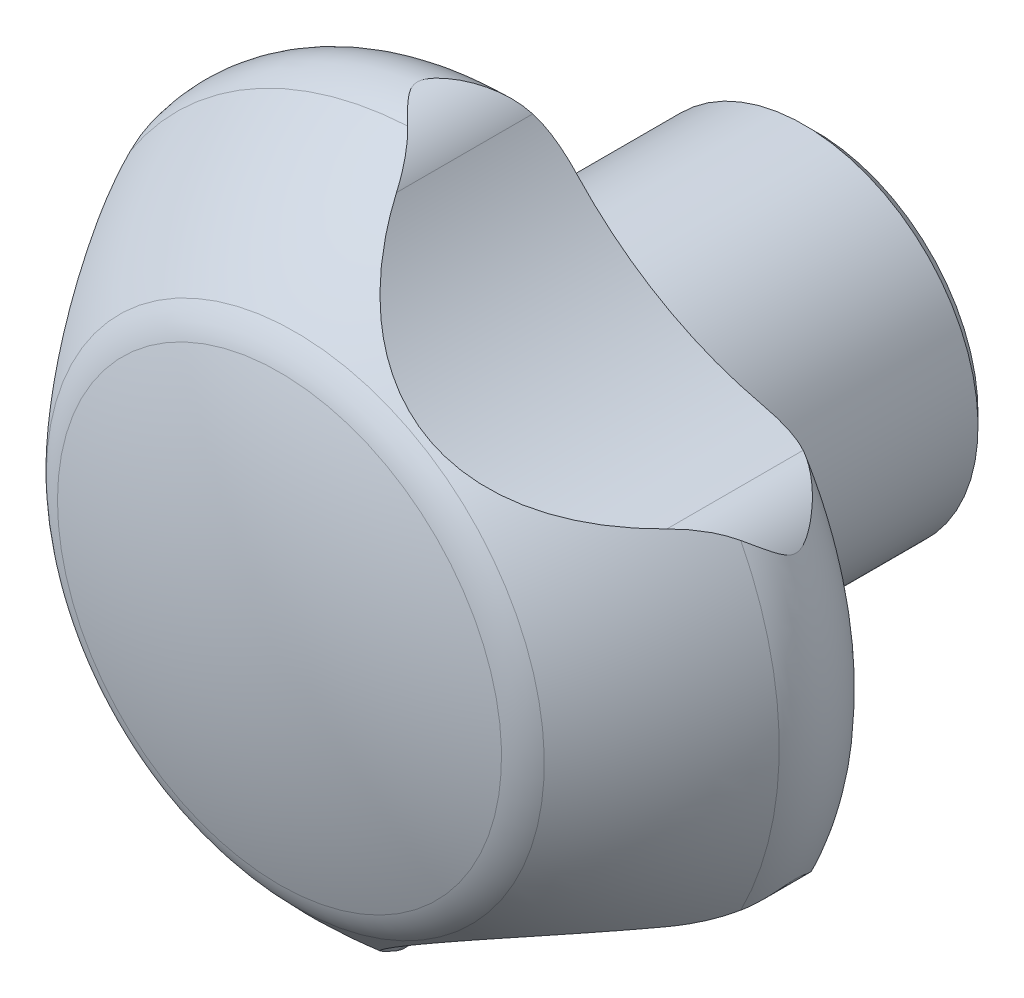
ISO-10303-21;
HEADER;
FILE_DESCRIPTION(('STEP AP214'),'2;1');
FILE_NAME('part.step','',(''),(''),'','','');
FILE_SCHEMA(('AUTOMOTIVE_DESIGN { 1 0 10303 214 1 1 1 1 }'));
ENDSEC;
DATA;
#1=APPLICATION_CONTEXT('core data for automotive mechanical design processes');
#2=APPLICATION_PROTOCOL_DEFINITION('international standard','automotive_design',2000,#1);
#3=PRODUCT_CONTEXT('',#1,'mechanical');
#4=PRODUCT('Part','Part','',(#3));
#5=PRODUCT_RELATED_PRODUCT_CATEGORY('part','',(#4));
#6=PRODUCT_DEFINITION_FORMATION('','',#4);
#7=PRODUCT_DEFINITION_CONTEXT('part definition',#1,'design');
#8=PRODUCT_DEFINITION('design','',#6,#7);
#9=PRODUCT_DEFINITION_SHAPE('','',#8);
#10=(LENGTH_UNIT() NAMED_UNIT(*) SI_UNIT(.MILLI.,.METRE.));
#11=(NAMED_UNIT(*) PLANE_ANGLE_UNIT() SI_UNIT($,.RADIAN.));
#12=(NAMED_UNIT(*) SI_UNIT($,.STERADIAN.) SOLID_ANGLE_UNIT());
#13=UNCERTAINTY_MEASURE_WITH_UNIT(LENGTH_MEASURE(1.E-05),#10,'distance_accuracy_value','');
#14=(GEOMETRIC_REPRESENTATION_CONTEXT(3) GLOBAL_UNCERTAINTY_ASSIGNED_CONTEXT((#13)) GLOBAL_UNIT_ASSIGNED_CONTEXT((#10,
#11,#12)) REPRESENTATION_CONTEXT('',''));
#15=CARTESIAN_POINT('',(0.,0.,0.));
#16=DIRECTION('',(0.,0.,1.));
#17=DIRECTION('',(1.,0.,0.));
#18=AXIS2_PLACEMENT_3D('',#15,#16,#17);
#19=CARTESIAN_POINT('',(0.,0.,12.5));
#20=DIRECTION('',(0.,0.,1.));
#21=DIRECTION('',(0.,-1.,0.));
#22=AXIS2_PLACEMENT_3D('',#19,#20,#21);
#23=TOROIDAL_SURFACE('',#22,10.,2.5);
#24=CARTESIAN_POINT('',(0.,0.,10.));
#25=DIRECTION('',(0.,0.,1.));
#26=DIRECTION('',(0.,-1.,0.));
#27=AXIS2_PLACEMENT_3D('',#24,#25,#26);
#28=CIRCLE('',#27,10.);
#29=CARTESIAN_POINT('',(-9.30147058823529,-3.67187212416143,10.));
#30=VERTEX_POINT('',#29);
#31=CARTESIAN_POINT('',(1.47080075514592,-9.89124588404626,10.));
#32=VERTEX_POINT('',#31);
#33=EDGE_CURVE('E347',#30,#32,#28,.T.);
#34=ORIENTED_EDGE('',*,*,#33,.T.);
#35=CARTESIAN_POINT('',(9.64881165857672,-5.94121587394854,10.3839357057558));
#36=CARTESIAN_POINT('',(9.55240974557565,-5.94874540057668,10.3347563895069));
#37=CARTESIAN_POINT('',(9.45347928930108,-5.95764123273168,10.2910191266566));
#38=CARTESIAN_POINT('',(9.25225911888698,-5.9782407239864,10.213818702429));
#39=CARTESIAN_POINT('',(9.14997919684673,-5.98993673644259,10.180328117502));
#40=CARTESIAN_POINT('',(8.9458623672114,-6.01591531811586,10.1234885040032));
#41=CARTESIAN_POINT('',(8.84408086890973,-6.03012419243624,10.0999022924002));
#42=CARTESIAN_POINT('',(8.63935266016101,-6.06132463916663,10.060764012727));
#43=CARTESIAN_POINT('',(8.53640512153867,-6.07831832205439,10.045218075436));
#44=CARTESIAN_POINT('',(8.28100929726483,-6.12380513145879,10.0155204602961));
#45=CARTESIAN_POINT('',(8.12836206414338,-6.15391796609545,10.0055674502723));
#46=CARTESIAN_POINT('',(7.82399132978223,-6.21990963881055,9.99799980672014));
#47=CARTESIAN_POINT('',(7.67226872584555,-6.2557933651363,10.0003956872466));
#48=CARTESIAN_POINT('',(7.36882993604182,-6.33356587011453,10.0144912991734));
#49=CARTESIAN_POINT('',(7.21713763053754,-6.37552423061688,10.0263071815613));
#50=CARTESIAN_POINT('',(6.91601501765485,-6.46494498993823,10.056255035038));
#51=CARTESIAN_POINT('',(6.76658552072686,-6.51240931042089,10.0743892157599));
#52=CARTESIAN_POINT('',(6.33328633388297,-6.65902759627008,10.1321325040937));
#53=CARTESIAN_POINT('',(6.05245361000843,-6.7655000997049,10.1761290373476));
#54=CARTESIAN_POINT('',(5.63685535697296,-6.94045138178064,10.2353323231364));
#55=CARTESIAN_POINT('',(5.49930725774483,-7.0012871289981,10.2539299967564));
#56=CARTESIAN_POINT('',(5.22603412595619,-7.12811815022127,10.2864740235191));
#57=CARTESIAN_POINT('',(5.09030886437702,-7.19411276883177,10.3004209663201));
#58=CARTESIAN_POINT('',(4.82110680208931,-7.33111176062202,10.3216955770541));
#59=CARTESIAN_POINT('',(4.68762704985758,-7.40210879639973,10.3290327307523));
#60=CARTESIAN_POINT('',(4.42317896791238,-7.54899501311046,10.3360305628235));
#61=CARTESIAN_POINT('',(4.29221050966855,-7.6248839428,10.3356916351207));
#62=CARTESIAN_POINT('',(4.03324086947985,-7.78128817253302,10.327387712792));
#63=CARTESIAN_POINT('',(3.90524113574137,-7.86180566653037,10.3194190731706));
#64=CARTESIAN_POINT('',(3.65264231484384,-8.02715315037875,10.2970311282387));
#65=CARTESIAN_POINT('',(3.52804364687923,-8.11198366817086,10.2826110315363));
#66=CARTESIAN_POINT('',(3.29472706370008,-8.27706190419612,10.2509920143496));
#67=CARTESIAN_POINT('',(3.18567001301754,-8.35691556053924,10.2342170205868));
#68=CARTESIAN_POINT('',(2.97038504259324,-8.51996878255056,10.1988280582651));
#69=CARTESIAN_POINT('',(2.86415748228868,-8.60316876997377,10.1802138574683));
#70=CARTESIAN_POINT('',(2.54931904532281,-8.85806855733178,10.1243775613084));
#71=CARTESIAN_POINT('',(2.34481093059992,-9.03488517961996,10.0872055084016));
#72=CARTESIAN_POINT('',(1.94959880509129,-9.39980397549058,10.0290031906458));
#73=CARTESIAN_POINT('',(1.75871962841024,-9.58766420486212,10.0077101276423));
#74=CARTESIAN_POINT('',(1.48162058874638,-9.87857331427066,9.99871647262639));
#75=CARTESIAN_POINT('',(1.39089880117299,-9.97693386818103,9.99952758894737));
#76=CARTESIAN_POINT('',(1.21294910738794,-10.1761877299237,10.0107638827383));
#77=CARTESIAN_POINT('',(1.12571866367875,-10.277079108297,10.0211819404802));
#78=CARTESIAN_POINT('',(0.975447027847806,-10.4565672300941,10.0498041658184));
#79=CARTESIAN_POINT('',(0.911543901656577,-10.5348236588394,10.0655993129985));
#80=CARTESIAN_POINT('',(0.786571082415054,-10.6916606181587,10.1048265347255));
#81=CARTESIAN_POINT('',(0.72550023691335,-10.7702410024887,10.1282554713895));
#82=CARTESIAN_POINT('',(0.604718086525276,-10.9294722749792,10.1844371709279));
#83=CARTESIAN_POINT('',(0.545113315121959,-11.010108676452,10.2174650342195));
#84=CARTESIAN_POINT('',(0.429828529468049,-11.1698977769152,10.2932437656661));
#85=CARTESIAN_POINT('',(0.374157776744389,-11.2490466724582,10.3360166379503));
#86=CARTESIAN_POINT('',(0.320814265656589,-11.3267585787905,10.3839570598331));
#87=B_SPLINE_CURVE_WITH_KNOTS('',3,(#35,#36,#37,#38,#39,#40,#41,#42,#43,#44,#45,#46,#47,#48,#49,
#50,#51,#52,#53,#54,#55,#56,#57,#58,#59,#60,#61,#62,#63,#64,#65,#66,#67,#68,#69,#70,#71,#72,#73,
#74,#75,#76,#77,#78,#79,#80,#81,#82,#83,#84,#85,#86),.UNSPECIFIED.,.F.,.F.,(4,2,2,2,2,2,2,2,2,2,
2,2,2,2,2,2,2,2,2,2,2,2,2,2,2,4),(0.,0.325096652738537,0.649315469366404,0.9652532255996,
1.28143153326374,1.74835778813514,2.21568165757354,2.68885856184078,3.16220111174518,
4.07184201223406,4.52637344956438,4.98084723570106,5.43466775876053,5.88846499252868,
6.34247913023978,6.79654897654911,7.20506415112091,7.61363097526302,8.43172203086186,
9.23595334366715,9.63706496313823,10.0378795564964,10.3443780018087,10.6507506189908,
10.9669557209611,11.2838820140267),.UNSPECIFIED.);
#88=CARTESIAN_POINT('',(0.320951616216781,-11.3265585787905,10.3838337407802));
#89=VERTEX_POINT('',#88);
#90=EDGE_CURVE('E157',#32,#89,#87,.T.);
#91=ORIENTED_EDGE('',*,*,#90,.T.);
#92=CARTESIAN_POINT('',(-0.642454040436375,-12.1575268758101,13.733528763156));
#93=CARTESIAN_POINT('',(-0.696997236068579,-12.1841956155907,13.6814692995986));
#94=CARTESIAN_POINT('',(-0.751897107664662,-12.2085342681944,13.6285896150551));
#95=CARTESIAN_POINT('',(-0.861784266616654,-12.2527309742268,13.5208027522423));
#96=CARTESIAN_POINT('',(-0.916771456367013,-12.2725783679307,13.4658911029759));
#97=CARTESIAN_POINT('',(-1.02709142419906,-12.3082187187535,13.3527182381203));
#98=CARTESIAN_POINT('',(-1.08240716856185,-12.3239176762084,13.2944108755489));
#99=CARTESIAN_POINT('',(-1.19078611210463,-12.3508541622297,13.1748286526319));
#100=CARTESIAN_POINT('',(-1.24385227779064,-12.3620977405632,13.1135579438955));
#101=CARTESIAN_POINT('',(-1.32613346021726,-12.3770049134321,13.0098248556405));
#102=CARTESIAN_POINT('',(-1.35690917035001,-12.3819338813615,12.968790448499));
#103=CARTESIAN_POINT('',(-1.41480844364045,-12.3902107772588,12.8840815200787));
#104=CARTESIAN_POINT('',(-1.44193924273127,-12.3935618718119,12.8404124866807));
#105=CARTESIAN_POINT('',(-1.4822509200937,-12.3980110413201,12.7633629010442));
#106=CARTESIAN_POINT('',(-1.49715875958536,-12.3994848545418,12.7309310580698));
#107=CARTESIAN_POINT('',(-1.52200936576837,-12.4017841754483,12.6642145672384));
#108=CARTESIAN_POINT('',(-1.53196870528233,-12.4026118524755,12.6299365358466));
#109=CARTESIAN_POINT('',(-1.54387662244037,-12.4035749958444,12.5662300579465));
#110=CARTESIAN_POINT('',(-1.54693165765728,-12.4038071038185,12.5370180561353));
#111=CARTESIAN_POINT('',(-1.54783749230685,-12.4038771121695,12.4785238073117));
#112=CARTESIAN_POINT('',(-1.54569095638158,-12.4037152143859,12.4492416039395));
#113=CARTESIAN_POINT('',(-1.53548694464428,-12.4029009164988,12.3844093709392));
#114=CARTESIAN_POINT('',(-1.52611377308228,-12.4021383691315,12.3490753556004));
#115=CARTESIAN_POINT('',(-1.50193718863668,-12.3999443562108,12.2802918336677));
#116=CARTESIAN_POINT('',(-1.4871099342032,-12.3985099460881,12.2468513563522));
#117=CARTESIAN_POINT('',(-1.4480040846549,-12.3942703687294,12.1701849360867));
#118=CARTESIAN_POINT('',(-1.42224326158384,-12.3911580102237,12.1277540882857));
#119=CARTESIAN_POINT('',(-1.36709414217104,-12.3834750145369,12.0454205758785));
#120=CARTESIAN_POINT('',(-1.33769722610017,-12.3789008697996,12.0055242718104));
#121=CARTESIAN_POINT('',(-1.24609305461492,-12.3627958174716,11.8880966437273));
#122=CARTESIAN_POINT('',(-1.18078331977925,-12.3489088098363,11.8133300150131));
#123=CARTESIAN_POINT('',(-1.04176367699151,-12.3129928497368,11.661925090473));
#124=CARTESIAN_POINT('',(-0.967810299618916,-12.29037502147,11.5856625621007));
#125=CARTESIAN_POINT('',(-0.81913917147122,-12.2368856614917,11.4366965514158));
#126=CARTESIAN_POINT('',(-0.744420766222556,-12.206006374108,11.363996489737));
#127=CARTESIAN_POINT('',(-0.596325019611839,-12.1358994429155,11.222272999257));
#128=CARTESIAN_POINT('',(-0.522942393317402,-12.096721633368,11.1532305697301));
#129=CARTESIAN_POINT('',(-0.378332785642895,-12.0096847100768,11.0185507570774));
#130=CARTESIAN_POINT('',(-0.307104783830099,-11.9618297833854,10.9529117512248));
#131=CARTESIAN_POINT('',(-0.135032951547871,-11.832443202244,10.795318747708));
#132=CARTESIAN_POINT('',(-0.0360255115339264,-11.7456611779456,10.7055167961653));
#133=CARTESIAN_POINT('',(0.104529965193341,-11.6002945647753,10.5785375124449));
#134=CARTESIAN_POINT('',(0.150210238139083,-11.5490883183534,10.5373602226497));
#135=CARTESIAN_POINT('',(0.23827621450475,-11.441560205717,10.4580948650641));
#136=CARTESIAN_POINT('',(0.280657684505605,-11.3852319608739,10.420010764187));
#137=CARTESIAN_POINT('',(0.321088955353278,-11.3263585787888,10.3837104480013));
#138=B_SPLINE_CURVE_WITH_KNOTS('',3,(#92,#93,#94,#95,#96,#97,#98,#99,#100,#101,#102,#103,#104,
#105,#106,#107,#108,#109,#110,#111,#112,#113,#114,#115,#116,#117,#118,#119,#120,#121,#122,#123,
#124,#125,#126,#127,#128,#129,#130,#131,#132,#133,#134,#135,#136,#137),.UNSPECIFIED.,.F.,.F.,(4,
2,2,2,2,2,2,2,2,2,2,2,2,2,2,2,2,2,2,2,2,2,4),(0.,0.239896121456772,0.480355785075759,
0.725870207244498,0.971050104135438,1.12552181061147,1.27968217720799,1.38659462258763,
1.49314655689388,1.58082528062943,1.66845909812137,1.77749759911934,1.88701851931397,
2.03584385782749,2.18502901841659,2.48516109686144,2.81065631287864,3.13645817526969,
3.46035635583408,3.78409865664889,4.26018660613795,4.50001569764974,4.74014765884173),.UNSPECIFIED.);
#139=CARTESIAN_POINT('',(-0.642663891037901,-12.1576293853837,13.733328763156));
#140=VERTEX_POINT('',#139);
#141=EDGE_CURVE('E152',#140,#89,#138,.T.);
#142=ORIENTED_EDGE('',*,*,#141,.F.);
#143=CARTESIAN_POINT('',(0.,0.,13.733328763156));
#144=DIRECTION('',(0.,0.,1.));
#145=DIRECTION('',(0.,-1.,0.));
#146=AXIS2_PLACEMENT_3D('',#143,#144,#145);
#147=CIRCLE('',#146,12.1746034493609);
#148=CARTESIAN_POINT('',(-10.2074839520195,-6.63537794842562,13.733328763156));
#149=VERTEX_POINT('',#148);
#150=EDGE_CURVE('E353',#149,#140,#147,.T.);
#151=ORIENTED_EDGE('',*,*,#150,.F.);
#152=CARTESIAN_POINT('',(-9.96946778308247,-5.38512703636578,10.3837211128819));
#153=CARTESIAN_POINT('',(-10.0032587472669,-5.45589653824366,10.4235828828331));
#154=CARTESIAN_POINT('',(-10.0332185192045,-5.52719326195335,10.4656068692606));
#155=CARTESIAN_POINT('',(-10.0858203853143,-5.67007341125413,10.5533298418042));
#156=CARTESIAN_POINT('',(-10.1084734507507,-5.7416562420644,10.5990231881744));
#157=CARTESIAN_POINT('',(-10.1468417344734,-5.88431855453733,10.6934005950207));
#158=CARTESIAN_POINT('',(-10.1625799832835,-5.95539891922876,10.7420741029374));
#159=CARTESIAN_POINT('',(-10.1876422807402,-6.09679870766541,10.8421475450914));
#160=CARTESIAN_POINT('',(-10.1969634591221,-6.16711777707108,10.8935486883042));
#161=CARTESIAN_POINT('',(-10.2109600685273,-6.32160411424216,11.0101499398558));
#162=CARTESIAN_POINT('',(-10.2141902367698,-6.40546861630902,11.0759257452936));
#163=CARTESIAN_POINT('',(-10.2124994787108,-6.57051564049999,11.2106887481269));
#164=CARTESIAN_POINT('',(-10.2075756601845,-6.65169720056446,11.2796770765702));
#165=CARTESIAN_POINT('',(-10.1904250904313,-6.81037059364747,11.4207937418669));
#166=CARTESIAN_POINT('',(-10.1782029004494,-6.88786469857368,11.4929200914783));
#167=CARTESIAN_POINT('',(-10.1475233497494,-7.03792445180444,11.6408036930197));
#168=CARTESIAN_POINT('',(-10.1290713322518,-7.11049425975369,11.7165577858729));
#169=CARTESIAN_POINT('',(-10.0964170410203,-7.21960721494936,11.8409561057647));
#170=CARTESIAN_POINT('',(-10.0836246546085,-7.25861264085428,11.8878182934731));
#171=CARTESIAN_POINT('',(-10.0573180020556,-7.33299279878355,11.9842599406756));
#172=CARTESIAN_POINT('',(-10.043803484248,-7.36836625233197,12.0338403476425));
#173=CARTESIAN_POINT('',(-10.0209311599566,-7.42485321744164,12.1238255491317));
#174=CARTESIAN_POINT('',(-10.0113943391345,-7.44729985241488,12.1633334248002));
#175=CARTESIAN_POINT('',(-9.99401523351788,-7.48689414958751,12.2453102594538));
#176=CARTESIAN_POINT('',(-9.98616779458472,-7.50405799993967,12.2877696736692));
#177=CARTESIAN_POINT('',(-9.97625037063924,-7.52538005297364,12.3605354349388));
#178=CARTESIAN_POINT('',(-9.97312059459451,-7.53198425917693,12.3899507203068));
#179=CARTESIAN_POINT('',(-9.96905336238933,-7.54053650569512,12.449556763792));
#180=CARTESIAN_POINT('',(-9.96810948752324,-7.54249817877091,12.4797449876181));
#181=CARTESIAN_POINT('',(-9.96862325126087,-7.54142459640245,12.5400612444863));
#182=CARTESIAN_POINT('',(-9.97008532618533,-7.53838011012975,12.5701890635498));
#183=CARTESIAN_POINT('',(-9.97508326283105,-7.527833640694,12.6295055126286));
#184=CARTESIAN_POINT('',(-9.97862461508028,-7.52031985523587,12.6586914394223));
#185=CARTESIAN_POINT('',(-9.99009635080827,-7.49548748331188,12.7354607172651));
#186=CARTESIAN_POINT('',(-9.99936747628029,-7.47498280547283,12.7817716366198));
#187=CARTESIAN_POINT('',(-10.0195619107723,-7.42812019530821,12.8713209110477));
#188=CARTESIAN_POINT('',(-10.0305015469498,-7.40170305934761,12.9145218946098));
#189=CARTESIAN_POINT('',(-10.0515468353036,-7.34793344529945,12.9945296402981));
#190=CARTESIAN_POINT('',(-10.0616351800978,-7.32089765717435,13.0315570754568));
#191=CARTESIAN_POINT('',(-10.0814177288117,-7.26472765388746,13.1041052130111));
#192=CARTESIAN_POINT('',(-10.0911117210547,-7.23559233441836,13.1396251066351));
#193=CARTESIAN_POINT('',(-10.1191029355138,-7.14568576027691,13.2446502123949));
#194=CARTESIAN_POINT('',(-10.1362562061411,-7.08254537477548,13.3124380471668));
#195=CARTESIAN_POINT('',(-10.1649481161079,-6.95654688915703,13.4404097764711));
#196=CARTESIAN_POINT('',(-10.1767890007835,-6.89396096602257,13.5007974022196));
#197=CARTESIAN_POINT('',(-10.1957751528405,-6.76629580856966,13.6189437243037));
#198=CARTESIAN_POINT('',(-10.202945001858,-6.70123156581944,13.6767146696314));
#199=CARTESIAN_POINT('',(-10.2075001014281,-6.63514495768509,13.7335287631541));
#200=B_SPLINE_CURVE_WITH_KNOTS('',3,(#152,#153,#154,#155,#156,#157,#158,#159,#160,#161,#162,
#163,#164,#165,#166,#167,#168,#169,#170,#171,#172,#173,#174,#175,#176,#177,#178,#179,#180,#181,
#182,#183,#184,#185,#186,#187,#188,#189,#190,#191,#192,#193,#194,#195,#196,#197,#198,#199),
.UNSPECIFIED.,.F.,.F.,(4,2,2,2,2,2,2,2,2,2,2,2,2,2,2,2,2,2,2,2,2,2,2,4),(0.,0.263707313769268,
0.527016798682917,0.789442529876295,1.05198556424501,1.37144637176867,1.69102051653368,
2.01039514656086,2.32949654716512,2.51629690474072,2.70316279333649,2.84223053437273,
2.98086778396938,3.07143251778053,3.16173097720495,3.25219612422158,3.34290123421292,
3.49648691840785,3.65168539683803,3.79241803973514,3.93322525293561,4.21553107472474,
4.47866012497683,4.74039300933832),.UNSPECIFIED.);
#201=CARTESIAN_POINT('',(-9.96956327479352,-5.38532703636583,10.3838337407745));
#202=VERTEX_POINT('',#201);
#203=EDGE_CURVE('E147',#202,#149,#200,.T.);
#204=ORIENTED_EDGE('',*,*,#203,.F.);
#205=CARTESIAN_POINT('',(-9.96965875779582,-5.38552703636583,10.3839463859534));
#206=CARTESIAN_POINT('',(-9.92797856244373,-5.29827614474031,10.3347662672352));
#207=CARTESIAN_POINT('',(-9.88621731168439,-5.20815226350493,10.2910282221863));
#208=CARTESIAN_POINT('',(-9.80344677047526,-5.02359129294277,10.2138262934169));
#209=CARTESIAN_POINT('',(-9.76243575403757,-4.92916650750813,10.1803349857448));
#210=CARTESIAN_POINT('',(-9.68287522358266,-4.73940726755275,10.1234940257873));
#211=CARTESIAN_POINT('',(-9.64428959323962,-4.64415764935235,10.0999071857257));
#212=CARTESIAN_POINT('',(-9.56894558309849,-4.45125790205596,10.0607677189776));
#213=CARTESIAN_POINT('',(-9.53218861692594,-4.3536060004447,10.0452212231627));
#214=CARTESIAN_POINT('',(-9.44388369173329,-4.10968542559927,10.0155225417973));
#215=CARTESIAN_POINT('',(-9.39363889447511,-3.96243462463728,10.0055688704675));
#216=CARTESIAN_POINT('',(-9.29860450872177,-3.66584997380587,9.99799979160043));
#217=CARTESIAN_POINT('',(-9.25381960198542,-3.51651445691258,10.0003948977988));
#218=CARTESIAN_POINT('',(-9.1694533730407,-3.21484645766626,10.0144889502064));
#219=CARTESIAN_POINT('',(-9.12994424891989,-3.06249986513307,10.0263040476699));
#220=CARTESIAN_POINT('',(-9.05682349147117,-2.75701361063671,10.0562504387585));
#221=CARTESIAN_POINT('',(-9.02321392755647,-2.60387368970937,10.0743839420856));
#222=CARTESIAN_POINT('',(-8.93353699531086,-2.15531258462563,10.1321268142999));
#223=CARTESIAN_POINT('',(-8.88532666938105,-1.85886216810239,10.1761242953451));
#224=CARTESIAN_POINT('',(-8.82903766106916,-1.41145896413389,10.23532919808));
#225=CARTESIAN_POINT('',(-8.81294831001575,-1.26191795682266,10.2539274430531));
#226=CARTESIAN_POINT('',(-8.7861496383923,-0.961834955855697,10.2864725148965));
#227=CARTESIAN_POINT('',(-8.77543963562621,-0.811293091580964,10.3004199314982));
#228=CARTESIAN_POINT('',(-8.75948265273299,-0.509651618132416,10.3216952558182));
#229=CARTESIAN_POINT('',(-8.75422784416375,-0.358553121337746,10.3290326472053));
#230=CARTESIAN_POINT('',(-8.74921088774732,-0.0560849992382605,10.3360306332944));
#231=CARTESIAN_POINT('',(-8.74944845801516,0.0952846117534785,10.3356916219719));
#232=CARTESIAN_POINT('',(-8.75541401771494,0.397767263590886,10.3273872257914));
#233=CARTESIAN_POINT('',(-8.76114463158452,0.54888014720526,10.3194181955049));
#234=CARTESIAN_POINT('',(-8.77804113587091,0.850317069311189,10.297029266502));
#235=CARTESIAN_POINT('',(-8.78920769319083,1.00064100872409,10.2826085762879));
#236=CARTESIAN_POINT('',(-8.81551237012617,1.28524238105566,10.2509885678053));
#237=CARTESIAN_POINT('',(-8.83013958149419,1.41961649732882,10.2342132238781));
#238=CARTESIAN_POINT('',(-8.8637062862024,1.68758757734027,10.1988236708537));
#239=CARTESIAN_POINT('',(-8.88264632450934,1.82118444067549,10.1802092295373));
#240=CARTESIAN_POINT('',(-8.94597846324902,2.2212957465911,10.1243724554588));
#241=CARTESIAN_POINT('',(-8.99685335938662,2.48681550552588,10.0872004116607));
#242=CARTESIAN_POINT('',(-9.115279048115,3.01154285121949,10.0289992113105));
#243=CARTESIAN_POINT('',(-9.18253271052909,3.27078116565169,10.0077072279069));
#244=CARTESIAN_POINT('',(-9.2959202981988,3.65621323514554,9.9987162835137));
#245=CARTESIAN_POINT('',(-9.3357429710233,3.78396172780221,9.99952848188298));
#246=CARTESIAN_POINT('',(-9.41932870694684,4.03769915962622,10.0107673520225));
#247=CARTESIAN_POINT('',(-9.46308883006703,4.16368933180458,10.0211869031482));
#248=CARTESIAN_POINT('',(-9.54339332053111,4.38356682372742,10.0498112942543));
#249=CARTESIAN_POINT('',(-9.57921186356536,4.4780306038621,10.0656065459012));
#250=CARTESIAN_POINT('',(-9.65254609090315,4.6646665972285,10.1048331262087));
#251=CARTESIAN_POINT('',(-9.69006107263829,4.7568397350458,10.1282613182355));
#252=CARTESIAN_POINT('',(-9.76756358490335,4.94104384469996,10.1844404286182));
#253=CARTESIAN_POINT('',(-9.80759182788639,5.03297532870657,10.2174663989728));
#254=CARTESIAN_POINT('',(-9.88832567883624,5.2126980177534,10.2932400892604));
#255=CARTESIAN_POINT('',(-9.92903262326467,5.30047930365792,10.3360098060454));
#256=CARTESIAN_POINT('',(-9.96965875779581,5.38552703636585,10.3839463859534));
#257=B_SPLINE_CURVE_WITH_KNOTS('',3,(#205,#206,#207,#208,#209,#210,#211,#212,#213,#214,#215,
#216,#217,#218,#219,#220,#221,#222,#223,#224,#225,#226,#227,#228,#229,#230,#231,#232,#233,#234,
#235,#236,#237,#238,#239,#240,#241,#242,#243,#244,#245,#246,#247,#248,#249,#250,#251,#252,#253,
#254,#255,#256),.UNSPECIFIED.,.F.,.F.,(4,2,2,2,2,2,2,2,2,2,2,2,2,2,2,2,2,2,2,2,2,2,2,2,2,4),(0.,
0.325096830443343,0.649315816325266,0.965253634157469,1.28143200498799,1.74835241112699,
2.21567041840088,2.68884140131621,3.16217803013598,4.07183741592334,4.52637809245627,
4.98086111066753,5.43469102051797,5.88849763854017,6.34252118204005,6.79660044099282,
7.20511917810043,7.61368956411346,8.43178778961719,9.23602559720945,9.63714036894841,
10.0379580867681,10.3444374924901,10.6507911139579,10.9669760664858,11.2838820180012),.UNSPECIFIED.);
#258=EDGE_CURVE('E138',#202,#30,#257,.T.);
#259=ORIENTED_EDGE('',*,*,#258,.T.);
#260=EDGE_LOOP('',(#34,#91,#142,#151,#204,#259));
#261=FACE_BOUND('',#260,.T.);
#262=ADVANCED_FACE('F14',(#261),#23,.T.);
#263=CARTESIAN_POINT('',(0.321088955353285,11.3263585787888,10.3837104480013));
#264=CARTESIAN_POINT('',(0.276696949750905,11.3910073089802,10.4235715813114));
#265=CARTESIAN_POINT('',(0.229932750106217,11.4526017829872,10.465594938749));
#266=CARTESIAN_POINT('',(0.132497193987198,11.5695968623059,10.5533166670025));
#267=CARTESIAN_POINT('',(0.0818318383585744,11.6250066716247,10.5990093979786));
#268=CARTESIAN_POINT('',(-0.0225319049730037,11.7295663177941,10.6933855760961));
#269=CARTESIAN_POINT('',(-0.0762195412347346,11.778736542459,10.7420584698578));
#270=CARTESIAN_POINT('',(-0.186142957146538,11.8711417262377,10.8421306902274));
#271=CARTESIAN_POINT('',(-0.242379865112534,11.9143740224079,10.8935312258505));
#272=CARTESIAN_POINT('',(-0.369169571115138,12.0037396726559,11.010131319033));
#273=CARTESIAN_POINT('',(-0.440182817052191,12.0484699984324,11.0759065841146));
#274=CARTESIAN_POINT('',(-0.58396228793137,12.1295306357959,11.2106685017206));
#275=CARTESIAN_POINT('',(-0.656729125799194,12.165857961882,11.2796562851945));
#276=CARTESIAN_POINT('',(-0.80271901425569,12.2303432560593,11.4207718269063));
#277=CARTESIAN_POINT('',(-0.87594175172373,12.2585063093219,11.4928975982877));
#278=CARTESIAN_POINT('',(-1.02123686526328,12.3069683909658,11.6407799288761));
#279=CARTESIAN_POINT('',(-1.09331017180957,12.3272741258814,11.7165333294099));
#280=CARTESIAN_POINT('',(-1.20413360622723,12.3535526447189,11.8409317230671));
#281=CARTESIAN_POINT('',(-1.24431096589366,12.3619774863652,11.887794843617));
#282=CARTESIAN_POINT('',(-1.3218824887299,12.3763865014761,11.9842383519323));
#283=CARTESIAN_POINT('',(-1.35927566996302,12.3823698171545,12.0338196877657));
#284=CARTESIAN_POINT('',(-1.41963453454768,12.3908061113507,12.1238073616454));
#285=CARTESIAN_POINT('',(-1.44384413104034,12.3937706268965,12.1633168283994));
#286=CARTESIAN_POINT('',(-1.48682684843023,12.398517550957,12.2452970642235));
#287=CARTESIAN_POINT('',(-1.5056165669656,12.4003035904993,12.2877582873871));
#288=CARTESIAN_POINT('',(-1.5290425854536,12.4023760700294,12.3605261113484));
#289=CARTESIAN_POINT('',(-1.53632742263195,12.4029677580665,12.3899414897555));
#290=CARTESIAN_POINT('',(-1.54576859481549,12.4037216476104,12.4495478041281));
#291=CARTESIAN_POINT('',(-1.54793994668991,12.4038851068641,12.4797362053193));
#292=CARTESIAN_POINT('',(-1.54675433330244,12.4037933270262,12.5400529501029));
#293=CARTESIAN_POINT('',(-1.54338714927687,12.4035373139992,12.5701810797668));
#294=CARTESIAN_POINT('',(-1.53175540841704,12.4025924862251,12.6294981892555));
#295=CARTESIAN_POINT('',(-1.52347788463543,12.4019025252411,12.6586844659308));
#296=CARTESIAN_POINT('',(-1.4962376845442,12.3994212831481,12.7354530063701));
#297=CARTESIAN_POINT('',(-1.47384561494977,12.3971981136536,12.7817629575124));
#298=CARTESIAN_POINT('',(-1.42316635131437,12.3912560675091,12.8713104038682));
#299=CARTESIAN_POINT('',(-1.39481972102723,12.3875217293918,12.9145105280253));
#300=CARTESIAN_POINT('',(-1.33773217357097,12.3788630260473,12.9945182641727));
#301=CARTESIAN_POINT('',(-1.30927406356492,12.3740819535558,13.0315464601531));
#302=CARTESIAN_POINT('',(-1.25073750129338,12.3631292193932,13.1040960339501));
#303=CARTESIAN_POINT('',(-1.22065819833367,12.3569568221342,13.1396166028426));
#304=CARTESIAN_POINT('',(-1.12879995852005,12.3362446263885,13.2446436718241));
#305=CARTESIAN_POINT('',(-1.06554117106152,12.3195295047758,13.3124327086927));
#306=CARTESIAN_POINT('',(-0.942075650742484,12.2813778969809,13.4404063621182));
#307=CARTESIAN_POINT('',(-0.881953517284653,12.2603392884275,13.5007947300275));
#308=CARTESIAN_POINT('',(-0.761897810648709,12.2129487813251,13.6189424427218));
#309=CARTESIAN_POINT('',(-0.701964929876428,12.1866256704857,13.6767140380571));
#310=CARTESIAN_POINT('',(-0.642454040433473,12.1575268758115,13.7335287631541));
#311=B_SPLINE_CURVE_WITH_KNOTS('',3,(#263,#264,#265,#266,#267,#268,#269,#270,#271,#272,#273,
#274,#275,#276,#277,#278,#279,#280,#281,#282,#283,#284,#285,#286,#287,#288,#289,#290,#291,#292,
#293,#294,#295,#296,#297,#298,#299,#300,#301,#302,#303,#304,#305,#306,#307,#308,#309,#310),
.UNSPECIFIED.,.F.,.F.,(4,2,2,2,2,2,2,2,2,2,2,2,2,2,2,2,2,2,2,2,2,2,2,4),(0.,0.263705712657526,
0.527013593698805,0.789437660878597,1.05197903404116,1.37143876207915,1.69101181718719,
2.01038539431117,2.32948576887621,2.51629135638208,2.70316251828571,2.84223724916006,
2.98088144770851,3.07144685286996,3.16174595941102,3.25221185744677,3.34291772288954,
3.49649941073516,3.6516938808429,3.7924287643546,3.93323822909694,4.21554863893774,
4.47868074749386,4.74041653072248),.UNSPECIFIED.);
#312=CARTESIAN_POINT('',(0.320951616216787,11.3265585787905,10.3838337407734));
#313=VERTEX_POINT('',#312);
#314=CARTESIAN_POINT('',(-0.642663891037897,12.1576293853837,13.733328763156));
#315=VERTEX_POINT('',#314);
#316=EDGE_CURVE('E275',#313,#315,#311,.T.);
#317=ORIENTED_EDGE('',*,*,#316,.F.);
#318=CARTESIAN_POINT('',(0.320814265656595,11.3267585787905,10.3839570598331));
#319=CARTESIAN_POINT('',(0.375535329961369,11.2470372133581,10.3347761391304));
#320=CARTESIAN_POINT('',(0.432703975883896,11.1658090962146,10.2910373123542));
#321=CARTESIAN_POINT('',(0.551152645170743,11.0018473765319,10.2138338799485));
#322=CARTESIAN_POINT('',(0.612421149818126,10.9191184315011,10.1803418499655));
#323=CARTESIAN_POINT('',(0.73697673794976,10.7553373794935,10.1234995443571));
#324=CARTESIAN_POINT('',(0.800172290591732,10.6742964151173,10.0999120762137));
#325=CARTESIAN_POINT('',(0.929555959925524,10.5125966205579,10.0607714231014));
#326=CARTESIAN_POINT('',(0.995746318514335,10.4319381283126,10.0452243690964));
#327=CARTESIAN_POINT('',(1.16283357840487,10.2335048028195,10.0155246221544));
#328=CARTESIAN_POINT('',(1.26523255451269,10.1163674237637,10.0055702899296));
#329=CARTESIAN_POINT('',(1.47456202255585,9.88577533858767,9.99799977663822));
#330=CARTESIAN_POINT('',(1.58149629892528,9.77232385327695,10.0003941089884));
#331=CARTESIAN_POINT('',(1.80056201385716,9.548428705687,10.0144866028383));
#332=CARTESIAN_POINT('',(1.91274177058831,9.43804051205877,10.0263009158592));
#333=CARTESIAN_POINT('',(2.14073677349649,9.22197484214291,10.0562458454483));
#334=CARTESIAN_POINT('',(2.25655327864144,9.11629902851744,10.0743786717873));
#335=CARTESIAN_POINT('',(2.60018221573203,8.81435188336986,10.1321211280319));
#336=CARTESIAN_POINT('',(2.83281481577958,8.6243707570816,10.176119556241));
#337=CARTESIAN_POINT('',(3.19213950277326,8.3519151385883,10.2353260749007));
#338=CARTESIAN_POINT('',(3.31360342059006,8.26320883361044,10.2539248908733));
#339=CARTESIAN_POINT('',(3.5600882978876,8.0899551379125,10.2864710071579));
#340=CARTESIAN_POINT('',(3.68510880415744,8.00540722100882,10.3004188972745));
#341=CARTESIAN_POINT('',(3.93836453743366,7.84076377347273,10.321694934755));
#342=CARTESIAN_POINT('',(4.06659488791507,7.76066202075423,10.3290325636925));
#343=CARTESIAN_POINT('',(4.3260368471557,7.60507992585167,10.3360307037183));
#344=CARTESIAN_POINT('',(4.45724830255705,7.52959934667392,10.3356916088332));
#345=CARTESIAN_POINT('',(4.72219432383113,7.3835215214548,10.3273867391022));
#346=CARTESIAN_POINT('',(4.85593006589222,7.3129266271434,10.3194173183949));
#347=CARTESIAN_POINT('',(5.1254360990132,7.17683856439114,10.2970274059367));
#348=CARTESIAN_POINT('',(5.26120663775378,7.11134602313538,10.2826061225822));
#349=CARTESIAN_POINT('',(5.52083511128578,6.99182465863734,10.2509851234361));
#350=CARTESIAN_POINT('',(5.64452129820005,6.9373049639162,10.2342094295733));
#351=CARTESIAN_POINT('',(5.89337680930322,6.83238876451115,10.1988192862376));
#352=CARTESIAN_POINT('',(6.0185463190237,6.78199278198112,10.1802046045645));
#353=CARTESIAN_POINT('',(6.39672265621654,6.636784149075,10.1243673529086));
#354=CARTESIAN_POINT('',(6.65210951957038,6.54808320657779,10.087195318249));
#355=CARTESIAN_POINT('',(7.16575461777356,6.38827951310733,10.0289952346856));
#356=CARTESIAN_POINT('',(7.42389089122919,6.31690406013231,10.0077043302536));
#357=CARTESIAN_POINT('',(7.81438220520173,6.22238530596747,9.9987160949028));
#358=CARTESIAN_POINT('',(7.94492812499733,6.19299880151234,9.99952937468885));
#359=CARTESIAN_POINT('',(8.20646623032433,6.13851813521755,10.0107708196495));
#360=CARTESIAN_POINT('',(8.33745801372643,6.11342081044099,10.0211918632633));
#361=CARTESIAN_POINT('',(8.56802440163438,6.07302976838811,10.0498184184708));
#362=CARTESIAN_POINT('',(8.66773539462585,6.05681904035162,10.0656137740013));
#363=CARTESIAN_POINT('',(8.86602144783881,6.02701281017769,10.1048397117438));
#364=CARTESIAN_POINT('',(8.96459695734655,6.01341623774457,10.1282671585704));
#365=CARTESIAN_POINT('',(9.1628609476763,5.98843519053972,10.1844436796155));
#366=CARTESIAN_POINT('',(9.26248363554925,5.97713570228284,10.2174677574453));
#367=CARTESIAN_POINT('',(9.45848250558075,5.9571931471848,10.2932364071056));
#368=CARTESIAN_POINT('',(9.55485076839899,5.9485561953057,10.3360029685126));
#369=CARTESIAN_POINT('',(9.64881165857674,5.94121587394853,10.3839357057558));
#370=B_SPLINE_CURVE_WITH_KNOTS('',3,(#318,#319,#320,#321,#322,#323,#324,#325,#326,#327,#328,
#329,#330,#331,#332,#333,#334,#335,#336,#337,#338,#339,#340,#341,#342,#343,#344,#345,#346,#347,
#348,#349,#350,#351,#352,#353,#354,#355,#356,#357,#358,#359,#360,#361,#362,#363,#364,#365,#366,
#367,#368,#369),.UNSPECIFIED.,.F.,.F.,(4,2,2,2,2,2,2,2,2,2,2,2,2,2,2,2,2,2,2,2,2,2,2,2,2,4),(0.,
0.3250970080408,0.649316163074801,0.965254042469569,1.28143247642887,1.74834703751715,
2.2156591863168,2.68882425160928,3.16215496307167,4.07183282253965,4.52638273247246,
4.98087497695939,5.43471426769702,5.88853026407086,6.34256320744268,6.7966518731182,
7.20517417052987,7.61374811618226,8.43185350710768,9.23609780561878,9.63721572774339,
10.0380365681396,10.3444969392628,10.6508315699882,10.9669963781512,11.2838819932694),.UNSPECIFIED.);
#371=CARTESIAN_POINT('',(1.47080075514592,9.89124588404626,10.));
#372=VERTEX_POINT('',#371);
#373=EDGE_CURVE('E268',#313,#372,#370,.T.);
#374=ORIENTED_EDGE('',*,*,#373,.T.);
#375=CARTESIAN_POINT('',(-9.30147058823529,3.67187212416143,10.));
#376=VERTEX_POINT('',#375);
#377=EDGE_CURVE('E135',#372,#376,#28,.T.);
#378=ORIENTED_EDGE('',*,*,#377,.T.);
#379=CARTESIAN_POINT('',(-9.96956327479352,5.38532703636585,10.3838337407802));
#380=VERTEX_POINT('',#379);
#381=EDGE_CURVE('E118',#376,#380,#257,.T.);
#382=ORIENTED_EDGE('',*,*,#381,.T.);
#383=CARTESIAN_POINT('',(-10.2075001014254,6.63514495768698,13.7335287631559));
#384=CARTESIAN_POINT('',(-10.2033243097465,6.69571512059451,13.6814692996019));
#385=CARTESIAN_POINT('',(-10.1969522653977,6.75542913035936,13.6285896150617));
#386=CARTESIAN_POINT('',(-10.1802841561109,6.87269255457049,13.520802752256));
#387=CARTESIAN_POINT('',(-10.1699789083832,6.93023655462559,13.4658911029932));
#388=CARTESIAN_POINT('',(-10.1456843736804,7.04359662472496,13.3527182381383));
#389=CARTESIAN_POINT('',(-10.1316221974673,7.09935094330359,13.2944108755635));
#390=CARTESIAN_POINT('',(-10.1007604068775,7.2066781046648,13.1748286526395));
#391=CARTESIAN_POINT('',(-10.0839645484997,7.25825654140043,13.1135579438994));
#392=CARTESIAN_POINT('',(-10.0557339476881,7.33696772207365,13.0098248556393));
#393=CARTESIAN_POINT('',(-10.0446147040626,7.36608475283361,12.9687904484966));
#394=CARTESIAN_POINT('',(-10.022833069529,7.42036544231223,12.8840815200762));
#395=CARTESIAN_POINT('',(-10.0121698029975,7.4455369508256,12.8404124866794));
#396=CARTESIAN_POINT('',(-9.99586705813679,7.482672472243,12.7633629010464));
#397=CARTESIAN_POINT('',(-9.98968949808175,7.49631994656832,12.7309310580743));
#398=CARTESIAN_POINT('',(-9.97925546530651,7.51899086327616,12.6642145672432));
#399=CARTESIAN_POINT('',(-9.97499258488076,7.52802974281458,12.6299365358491));
#400=CARTESIAN_POINT('',(-9.96987273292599,7.53882387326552,12.5662300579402));
#401=CARTESIAN_POINT('',(-9.96854622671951,7.54158566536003,12.5370180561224));
#402=CARTESIAN_POINT('',(-9.9681539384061,7.54240514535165,12.4785238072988));
#403=CARTESIAN_POINT('',(-9.96908699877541,7.54046524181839,12.4492416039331));
#404=CARTESIAN_POINT('',(-9.97348380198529,7.53122115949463,12.3844093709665));
#405=CARTESIAN_POINT('',(-9.97751000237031,7.52272248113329,12.3490753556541));
#406=CARTESIAN_POINT('',(-9.98769822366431,7.50068793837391,12.2802918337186));
#407=CARTESIAN_POINT('',(-9.99386961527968,7.4871299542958,12.2468513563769));
#408=CARTESIAN_POINT('',(-10.0097509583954,7.45114350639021,12.170184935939));
#409=CARTESIAN_POINT('',(-10.0199359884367,7.42727779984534,12.1277540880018));
#410=CARTESIAN_POINT('',(-10.040856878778,7.37567576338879,12.045420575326));
#411=CARTESIAN_POINT('',(-10.05159401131,7.34793021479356,12.0055242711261));
#412=CARTESIAN_POINT('',(-10.0834487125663,7.26054614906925,11.8880966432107));
#413=CARTESIAN_POINT('',(-10.1040770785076,7.1970427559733,11.8133300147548));
#414=CARTESIAN_POINT('',(-10.1424827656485,7.05869023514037,11.6619250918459));
#415=CARTESIAN_POINT('',(-10.1598718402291,6.9833358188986,11.5856625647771));
#416=CARTESIAN_POINT('',(-10.1878842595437,6.82783816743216,11.4366965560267));
#417=CARTESIAN_POINT('',(-10.198501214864,6.74769048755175,11.363996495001));
#418=CARTESIAN_POINT('',(-10.2118347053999,6.58438234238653,11.2222730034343));
#419=CARTESIAN_POINT('',(-10.2145970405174,6.50124221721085,11.1532305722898));
#420=CARTESIAN_POINT('',(-10.2115256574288,6.33248815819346,11.0185507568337));
#421=CARTESIAN_POINT('',(-10.2056960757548,6.24687543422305,10.9529117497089));
#422=CARTESIAN_POINT('',(-10.1796803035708,6.03316666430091,10.7953210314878));
#423=CARTESIAN_POINT('',(-10.1540294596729,5.90403589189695,10.7055211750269));
#424=CARTESIAN_POINT('',(-10.0984182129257,5.70963275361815,10.5785446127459));
#425=CARTESIAN_POINT('',(-10.0769133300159,5.64447096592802,10.5373681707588));
#426=CARTESIAN_POINT('',(-10.0278263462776,5.51444271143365,10.4581043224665));
#427=CARTESIAN_POINT('',(-10.000236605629,5.44957672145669,10.4200208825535));
#428=CARTESIAN_POINT('',(-9.96946778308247,5.38512703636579,10.3837211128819));
#429=B_SPLINE_CURVE_WITH_KNOTS('',3,(#383,#384,#385,#386,#387,#388,#389,#390,#391,#392,#393,
#394,#395,#396,#397,#398,#399,#400,#401,#402,#403,#404,#405,#406,#407,#408,#409,#410,#411,#412,
#413,#414,#415,#416,#417,#418,#419,#420,#421,#422,#423,#424,#425,#426,#427,#428),.UNSPECIFIED.,
.F.,.F.,(4,2,2,2,2,2,2,2,2,2,2,2,2,2,2,2,2,2,2,2,2,2,4),(0.,0.239896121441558,0.480355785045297,
0.725870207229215,0.971050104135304,1.12552181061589,1.27968217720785,1.38659462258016,
1.49314655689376,1.5808252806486,1.66845909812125,1.77749759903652,1.88701851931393,
2.03584385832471,2.18502901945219,2.48516109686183,2.81065630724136,3.13645816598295,
3.46035635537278,3.78409865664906,4.26017502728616,4.49999817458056,4.74012416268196),.UNSPECIFIED.);
#430=CARTESIAN_POINT('',(-10.2074839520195,6.63537794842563,13.733328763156));
#431=VERTEX_POINT('',#430);
#432=EDGE_CURVE('E107',#431,#380,#429,.T.);
#433=ORIENTED_EDGE('',*,*,#432,.F.);
#434=EDGE_CURVE('E351',#315,#431,#147,.T.);
#435=ORIENTED_EDGE('',*,*,#434,.F.);
#436=EDGE_LOOP('',(#317,#374,#378,#382,#433,#435));
#437=FACE_BOUND('',#436,.T.);
#438=ADVANCED_FACE('F132',(#437),#23,.T.);
#439=CARTESIAN_POINT('',(0.,0.,0.));
#440=DIRECTION('',(0.,0.,1.));
#441=DIRECTION('',(0.,-1.,0.));
#442=AXIS2_PLACEMENT_3D('',#439,#440,#441);
#443=PLANE('',#442);
#444=CARTESIAN_POINT('',(0.,0.,0.));
#445=DIRECTION('',(0.,0.,1.));
#446=DIRECTION('',(0.,-1.,0.));
#447=AXIS2_PLACEMENT_3D('',#444,#445,#446);
#448=CIRCLE('',#447,4.25);
#449=CARTESIAN_POINT('',(0.,-4.25,0.));
#450=VERTEX_POINT('',#449);
#451=EDGE_CURVE('E370',#450,#450,#448,.T.);
#452=ORIENTED_EDGE('',*,*,#451,.F.);
#453=EDGE_LOOP('',(#452));
#454=FACE_BOUND('',#453,.T.);
#455=CARTESIAN_POINT('',(0.,0.,0.));
#456=DIRECTION('',(0.,0.,-1.));
#457=DIRECTION('',(0.,1.,0.));
#458=AXIS2_PLACEMENT_3D('',#455,#456,#457);
#459=CIRCLE('',#458,2.5);
#460=CARTESIAN_POINT('',(0.,2.5,0.));
#461=VERTEX_POINT('',#460);
#462=EDGE_CURVE('E398',#461,#461,#459,.T.);
#463=ORIENTED_EDGE('',*,*,#462,.F.);
#464=EDGE_LOOP('',(#463));
#465=FACE_BOUND('',#464,.T.);
#466=ADVANCED_FACE('F16',(#454,#465),#443,.F.);
#467=CARTESIAN_POINT('',(0.,0.,20.));
#468=DIRECTION('',(0.,0.,1.));
#469=DIRECTION('',(0.,-1.,0.));
#470=AXIS2_PLACEMENT_3D('',#467,#468,#469);
#471=CYLINDRICAL_SURFACE('',#470,4.25);
#472=CARTESIAN_POINT('',(0.,0.,0.3));
#473=DIRECTION('',(0.,0.,1.));
#474=DIRECTION('',(0.,-1.,0.));
#475=AXIS2_PLACEMENT_3D('',#472,#473,#474);
#476=CIRCLE('',#475,4.25);
#477=CARTESIAN_POINT('',(0.,-4.25,0.3));
#478=VERTEX_POINT('',#477);
#479=EDGE_CURVE('E368',#478,#478,#476,.T.);
#480=ORIENTED_EDGE('',*,*,#479,.F.);
#481=EDGE_LOOP('',(#480));
#482=FACE_BOUND('',#481,.T.);
#483=ORIENTED_EDGE('',*,*,#451,.T.);
#484=EDGE_LOOP('',(#483));
#485=FACE_BOUND('',#484,.T.);
#486=ADVANCED_FACE('F411',(#482,#485),#471,.T.);
#487=CARTESIAN_POINT('',(4.25,0.,0.3));
#488=DIRECTION('',(0.,0.,1.));
#489=DIRECTION('',(0.,-1.,0.));
#490=AXIS2_PLACEMENT_3D('',#487,#488,#489);
#491=PLANE('',#490);
#492=CARTESIAN_POINT('',(0.,0.,0.3));
#493=DIRECTION('',(0.,0.,1.));
#494=DIRECTION('',(0.,-1.,0.));
#495=AXIS2_PLACEMENT_3D('',#492,#493,#494);
#496=CIRCLE('',#495,5.6);
#497=CARTESIAN_POINT('',(0.,-5.6,0.3));
#498=VERTEX_POINT('',#497);
#499=EDGE_CURVE('E365',#498,#498,#496,.T.);
#500=ORIENTED_EDGE('',*,*,#499,.F.);
#501=EDGE_LOOP('',(#500));
#502=FACE_BOUND('',#501,.T.);
#503=ORIENTED_EDGE('',*,*,#479,.T.);
#504=EDGE_LOOP('',(#503));
#505=FACE_BOUND('',#504,.T.);
#506=ADVANCED_FACE('F416',(#502,#505),#491,.F.);
#507=CARTESIAN_POINT('',(0.,0.,0.3));
#508=DIRECTION('',(0.,0.,1.));
#509=DIRECTION('',(0.,-1.,0.));
#510=AXIS2_PLACEMENT_3D('',#507,#508,#509);
#511=CONICAL_SURFACE('',#510,5.6,0.785398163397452);
#512=CARTESIAN_POINT('',(0.,0.,0.7));
#513=DIRECTION('',(0.,0.,1.));
#514=DIRECTION('',(0.,-1.,0.));
#515=AXIS2_PLACEMENT_3D('',#512,#513,#514);
#516=CIRCLE('',#515,6.);
#517=CARTESIAN_POINT('',(0.,-6.,0.7));
#518=VERTEX_POINT('',#517);
#519=EDGE_CURVE('E360',#518,#518,#516,.T.);
#520=ORIENTED_EDGE('',*,*,#519,.F.);
#521=EDGE_LOOP('',(#520));
#522=FACE_BOUND('',#521,.T.);
#523=ORIENTED_EDGE('',*,*,#499,.T.);
#524=EDGE_LOOP('',(#523));
#525=FACE_BOUND('',#524,.T.);
#526=ADVANCED_FACE('F421',(#522,#525),#511,.T.);
#527=CARTESIAN_POINT('',(0.,0.,20.));
#528=DIRECTION('',(0.,0.,1.));
#529=DIRECTION('',(0.,-1.,0.));
#530=AXIS2_PLACEMENT_3D('',#527,#528,#529);
#531=CYLINDRICAL_SURFACE('',#530,6.);
#532=CARTESIAN_POINT('',(0.,0.,8.8));
#533=DIRECTION('',(0.,0.,1.));
#534=DIRECTION('',(0.,-1.,0.));
#535=AXIS2_PLACEMENT_3D('',#532,#533,#534);
#536=CIRCLE('',#535,6.);
#537=CARTESIAN_POINT('',(0.,-6.,8.8));
#538=VERTEX_POINT('',#537);
#539=EDGE_CURVE('E357',#538,#538,#536,.T.);
#540=ORIENTED_EDGE('',*,*,#539,.F.);
#541=EDGE_LOOP('',(#540));
#542=FACE_BOUND('',#541,.T.);
#543=ORIENTED_EDGE('',*,*,#519,.T.);
#544=EDGE_LOOP('',(#543));
#545=FACE_BOUND('',#544,.T.);
#546=ADVANCED_FACE('F428',(#542,#545),#531,.T.);
#547=CARTESIAN_POINT('',(0.,0.,8.8));
#548=DIRECTION('',(0.,0.,1.));
#549=DIRECTION('',(0.,-1.,0.));
#550=AXIS2_PLACEMENT_3D('',#547,#548,#549);
#551=TOROIDAL_SURFACE('',#550,7.2,1.2);
#552=CARTESIAN_POINT('',(0.,0.,10.));
#553=DIRECTION('',(0.,0.,1.));
#554=DIRECTION('',(0.,-1.,0.));
#555=AXIS2_PLACEMENT_3D('',#552,#553,#554);
#556=CIRCLE('',#555,7.2);
#557=CARTESIAN_POINT('',(0.,-7.2,10.));
#558=VERTEX_POINT('',#557);
#559=EDGE_CURVE('E355',#558,#558,#556,.T.);
#560=ORIENTED_EDGE('',*,*,#559,.F.);
#561=EDGE_LOOP('',(#560));
#562=FACE_BOUND('',#561,.T.);
#563=ORIENTED_EDGE('',*,*,#539,.T.);
#564=EDGE_LOOP('',(#563));
#565=FACE_BOUND('',#564,.T.);
#566=ADVANCED_FACE('F309',(#562,#565),#551,.F.);
#567=CARTESIAN_POINT('',(7.2,0.,10.));
#568=DIRECTION('',(0.,0.,1.));
#569=DIRECTION('',(0.,-1.,0.));
#570=AXIS2_PLACEMENT_3D('',#567,#568,#569);
#571=PLANE('',#570);
#572=CARTESIAN_POINT('',(7.83066983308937,-6.21937375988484,10.));
#573=VERTEX_POINT('',#572);
#574=CARTESIAN_POINT('',(7.83066983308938,6.21937375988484,10.));
#575=VERTEX_POINT('',#574);
#576=EDGE_CURVE('E349',#573,#575,#28,.T.);
#577=ORIENTED_EDGE('',*,*,#576,.F.);
#578=CARTESIAN_POINT('',(10.625,-18.4030398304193,10.));
#579=DIRECTION('',(0.,0.,1.));
#580=DIRECTION('',(0.,-1.,0.));
#581=AXIS2_PLACEMENT_3D('',#578,#579,#580);
#582=CIRCLE('',#581,12.5);
#583=EDGE_CURVE('E323',#32,#573,#582,.F.);
#584=ORIENTED_EDGE('',*,*,#583,.F.);
#585=ORIENTED_EDGE('',*,*,#33,.F.);
#586=CARTESIAN_POINT('',(-21.25,0.,10.));
#587=DIRECTION('',(0.,0.,1.));
#588=DIRECTION('',(0.,-1.,0.));
#589=AXIS2_PLACEMENT_3D('',#586,#587,#588);
#590=CIRCLE('',#589,12.5);
#591=EDGE_CURVE('E136',#376,#30,#590,.F.);
#592=ORIENTED_EDGE('',*,*,#591,.F.);
#593=ORIENTED_EDGE('',*,*,#377,.F.);
#594=CARTESIAN_POINT('',(10.625,18.4030398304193,10.));
#595=DIRECTION('',(0.,0.,1.));
#596=DIRECTION('',(0.,-1.,0.));
#597=AXIS2_PLACEMENT_3D('',#594,#595,#596);
#598=CIRCLE('',#597,12.5);
#599=EDGE_CURVE('E266',#575,#372,#598,.F.);
#600=ORIENTED_EDGE('',*,*,#599,.F.);
#601=EDGE_LOOP('',(#577,#584,#585,#592,#593,#600));
#602=FACE_BOUND('',#601,.T.);
#603=ORIENTED_EDGE('',*,*,#559,.T.);
#604=EDGE_LOOP('',(#603));
#605=FACE_BOUND('',#604,.T.);
#606=ADVANCED_FACE('F304',(#602,#605),#571,.F.);
#607=CARTESIAN_POINT('',(9.64841165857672,-5.9412472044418,10.3837317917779));
#608=CARTESIAN_POINT('',(9.72659555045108,-5.93512560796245,10.4235941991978));
#609=CARTESIAN_POINT('',(9.80332039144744,-5.92542247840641,10.4656188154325));
#610=CARTESIAN_POINT('',(9.95335944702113,-5.89953555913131,10.5533430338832));
#611=CARTESIAN_POINT('',(10.0266786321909,-5.88336156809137,10.5990369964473));
#612=CARTESIAN_POINT('',(10.1694121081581,-5.84525690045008,10.6934156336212));
#613=CARTESIAN_POINT('',(10.2388386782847,-5.82334572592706,10.7420897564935));
#614=CARTESIAN_POINT('',(10.3738256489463,-5.77434898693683,10.8421644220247));
#615=CARTESIAN_POINT('',(10.4393843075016,-5.74726111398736,10.8935661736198));
#616=CARTESIAN_POINT('',(10.5801713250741,-5.68213789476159,11.0101685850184));
#617=CARTESIAN_POINT('',(10.6544148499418,-5.64300231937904,11.0759449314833));
#618=CARTESIAN_POINT('',(10.796503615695,-5.55901317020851,11.2107090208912));
#619=CARTESIAN_POINT('',(10.8643465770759,-5.51415757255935,11.279697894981));
#620=CARTESIAN_POINT('',(10.993185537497,-5.41996682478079,11.4208156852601));
#621=CARTESIAN_POINT('',(11.0541857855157,-5.37063448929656,11.4929426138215));
#622=CARTESIAN_POINT('',(11.1688003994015,-5.26903441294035,11.6408274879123));
#623=CARTESIAN_POINT('',(11.2224210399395,-5.21676921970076,11.7165822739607));
#624=CARTESIAN_POINT('',(11.3005863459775,-5.13393402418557,11.8409805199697));
#625=CARTESIAN_POINT('',(11.327968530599,-5.10335372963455,11.887841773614));
#626=CARTESIAN_POINT('',(11.3792277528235,-5.04338351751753,11.9842815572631));
#627=CARTESIAN_POINT('',(11.4031035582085,-5.01399402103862,12.0338610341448));
#628=CARTESIAN_POINT('',(11.4405840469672,-4.96594519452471,12.1238437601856));
#629=CARTESIAN_POINT('',(11.4552537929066,-4.94646417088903,12.1633500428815));
#630=CARTESIAN_POINT('',(11.4808517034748,-4.91161904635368,12.2453234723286));
#631=CARTESIAN_POINT('',(11.4917913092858,-4.89624238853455,12.2877810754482));
#632=CARTESIAN_POINT('',(11.5052969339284,-4.87699414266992,12.3605447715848));
#633=CARTESIAN_POINT('',(11.5094511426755,-4.87098201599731,12.389959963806));
#634=CARTESIAN_POINT('',(11.5148233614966,-4.86318446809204,12.4495657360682));
#635=CARTESIAN_POINT('',(11.5160499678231,-4.86138667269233,12.479753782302));
#636=CARTESIAN_POINT('',(11.5153765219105,-4.8623692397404,12.5400695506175));
#637=CARTESIAN_POINT('',(11.5134706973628,-4.8651580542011,12.5701970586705));
#638=CARTESIAN_POINT('',(11.5068357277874,-4.87476023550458,12.6295128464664));
#639=CARTESIAN_POINT('',(11.5020991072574,-4.88158425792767,12.6586984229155));
#640=CARTESIAN_POINT('',(11.4863288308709,-4.9039361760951,12.7354684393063));
#641=CARTESIAN_POINT('',(11.4732061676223,-4.92221839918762,12.7817803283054));
#642=CARTESIAN_POINT('',(11.44271777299,-4.96314029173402,12.8713314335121));
#643=CARTESIAN_POINT('',(11.4253089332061,-4.98582370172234,12.9145332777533));
#644=CARTESIAN_POINT('',(11.3892649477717,-5.03093491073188,12.9945410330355));
#645=CARTESIAN_POINT('',(11.3708955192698,-5.05318931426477,13.0315677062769));
#646=CARTESIAN_POINT('',(11.3321423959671,-5.09840591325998,13.1041144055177));
#647=CARTESIAN_POINT('',(11.3117576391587,-5.12136847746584,13.139633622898));
#648=CARTESIAN_POINT('',(11.2478925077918,-5.19056178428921,13.2446567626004));
#649=CARTESIAN_POINT('',(11.201788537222,-5.23698634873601,13.3124433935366));
#650=CARTESIAN_POINT('',(11.1070176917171,-5.32483220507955,13.4404131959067));
#651=CARTESIAN_POINT('',(11.0587376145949,-5.36637915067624,13.5008000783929));
#652=CARTESIAN_POINT('',(10.9576704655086,-5.44665324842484,13.6189450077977));
#653=CARTESIAN_POINT('',(10.9049086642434,-5.48539419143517,13.6767153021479));
#654=CARTESIAN_POINT('',(10.8499541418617,-5.52238191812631,13.7335287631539));
#655=B_SPLINE_CURVE_WITH_KNOTS('',3,(#607,#608,#609,#610,#611,#612,#613,#614,#615,#616,#617,
#618,#619,#620,#621,#622,#623,#624,#625,#626,#627,#628,#629,#630,#631,#632,#633,#634,#635,#636,
#637,#638,#639,#640,#641,#642,#643,#644,#645,#646,#647,#648,#649,#650,#651,#652,#653,#654),
.UNSPECIFIED.,.F.,.F.,(4,2,2,2,2,2,2,2,2,2,2,2,2,2,2,2,2,2,2,2,2,2,2,4),(0.,0.263708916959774,
0.527020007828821,0.789447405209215,1.05199210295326,1.37145399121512,1.69102922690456,
2.01040491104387,2.32950733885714,2.51630245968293,2.70316306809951,2.84222381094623,
2.98085410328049,3.07141816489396,3.16171597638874,3.25218037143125,3.3428847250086,
3.49647441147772,3.65167690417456,3.79240730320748,3.93321226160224,4.21551348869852,
4.47863947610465,4.7403694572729),.UNSPECIFIED.);
#656=CARTESIAN_POINT('',(9.64861165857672,-5.94123154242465,10.3838337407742));
#657=VERTEX_POINT('',#656);
#658=CARTESIAN_POINT('',(10.8501478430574,-5.52225143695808,13.733328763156));
#659=VERTEX_POINT('',#658);
#660=EDGE_CURVE('E314',#657,#659,#655,.T.);
#661=ORIENTED_EDGE('',*,*,#660,.F.);
#662=EDGE_CURVE('E316',#657,#573,#87,.T.);
#663=ORIENTED_EDGE('',*,*,#662,.T.);
#664=ORIENTED_EDGE('',*,*,#576,.T.);
#665=CARTESIAN_POINT('',(9.64861165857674,5.94123154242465,10.3838337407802));
#666=VERTEX_POINT('',#665);
#667=EDGE_CURVE('E258',#575,#666,#370,.T.);
#668=ORIENTED_EDGE('',*,*,#667,.T.);
#669=CARTESIAN_POINT('',(10.8499541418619,5.52238191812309,13.7335287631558));
#670=CARTESIAN_POINT('',(10.9003215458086,5.48848049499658,13.6814692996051));
#671=CARTESIAN_POINT('',(10.9488493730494,5.45310513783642,13.6285896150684));
#672=CARTESIAN_POINT('',(11.0420684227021,5.38003841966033,13.5208027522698));
#673=CARTESIAN_POINT('',(11.086750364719,5.34234181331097,13.4658911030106));
#674=CARTESIAN_POINT('',(11.1727757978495,5.2646220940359,13.3527182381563));
#675=CARTESIAN_POINT('',(11.2140293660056,5.2245667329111,13.2944108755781));
#676=CARTESIAN_POINT('',(11.291546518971,5.14417605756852,13.1748286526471));
#677=CARTESIAN_POINT('',(11.3278168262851,5.10384119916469,13.1135579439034));
#678=CARTESIAN_POINT('',(11.3818674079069,5.04003719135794,13.0098248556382));
#679=CARTESIAN_POINT('',(11.4015238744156,5.01584912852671,12.9687904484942));
#680=CARTESIAN_POINT('',(11.437641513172,4.96984533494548,12.8840815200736));
#681=CARTESIAN_POINT('',(11.4541090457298,4.94802492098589,12.8404124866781));
#682=CARTESIAN_POINT('',(11.4781179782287,4.91533856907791,12.7633629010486));
#683=CARTESIAN_POINT('',(11.4868482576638,4.9031649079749,12.7309310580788));
#684=CARTESIAN_POINT('',(11.5012648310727,4.88279331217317,12.6642145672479));
#685=CARTESIAN_POINT('',(11.5069612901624,4.87458210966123,12.6299365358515));
#686=CARTESIAN_POINT('',(11.5137493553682,4.86475112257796,12.5662300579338));
#687=CARTESIAN_POINT('',(11.5154778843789,4.86222143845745,12.5370180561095));
#688=CARTESIAN_POINT('',(11.5159914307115,4.86147196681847,12.4785238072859));
#689=CARTESIAN_POINT('',(11.5147779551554,4.86324997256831,12.4492416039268));
#690=CARTESIAN_POINT('',(11.5089707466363,4.87167975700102,12.3844093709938));
#691=CARTESIAN_POINT('',(11.5036237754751,4.87941588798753,12.3490753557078));
#692=CARTESIAN_POINT('',(11.4896354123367,4.89925641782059,12.2802918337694));
#693=CARTESIAN_POINT('',(11.4809795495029,4.91137999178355,12.2468513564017));
#694=CARTESIAN_POINT('',(11.4577550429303,4.94312686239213,12.1701849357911));
#695=CARTESIAN_POINT('',(11.4421792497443,4.96388021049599,12.1277540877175));
#696=CARTESIAN_POINT('',(11.407951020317,5.00779925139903,12.0454205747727));
#697=CARTESIAN_POINT('',(11.3892912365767,5.03097065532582,12.005524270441));
#698=CARTESIAN_POINT('',(11.3295417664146,5.10224966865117,11.8880966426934));
#699=CARTESIAN_POINT('',(11.2848603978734,5.15186605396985,11.8133300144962));
#700=CARTESIAN_POINT('',(11.1842464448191,5.25430261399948,11.6619250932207));
#701=CARTESIAN_POINT('',(11.1276821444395,5.30703920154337,11.585662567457));
#702=CARTESIAN_POINT('',(11.0070234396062,5.40904749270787,11.4366965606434));
#703=CARTESIAN_POINT('',(10.9429219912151,5.45831588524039,11.3639965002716));
#704=CARTESIAN_POINT('',(10.808159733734,5.55151710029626,11.2222730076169));
#705=CARTESIAN_POINT('',(10.7375394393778,5.59547941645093,11.1532305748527));
#706=CARTESIAN_POINT('',(10.5898584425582,5.67719655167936,11.0185507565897));
#707=CARTESIAN_POINT('',(10.5128008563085,5.71495434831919,10.9529117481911));
#708=CARTESIAN_POINT('',(10.3147186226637,5.79927718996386,10.7953233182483));
#709=CARTESIAN_POINT('',(10.190065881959,5.84162745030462,10.7055255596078));
#710=CARTESIAN_POINT('',(9.99390744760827,5.89066777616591,10.5785517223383));
#711=CARTESIAN_POINT('',(9.92672508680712,5.90462486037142,10.5373761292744));
#712=CARTESIAN_POINT('',(9.78957763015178,5.92712864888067,10.4581137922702));
#713=CARTESIAN_POINT('',(9.7196091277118,5.93566849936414,10.4200310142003));
#714=CARTESIAN_POINT('',(9.64841165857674,5.94124720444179,10.3837317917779));
#715=B_SPLINE_CURVE_WITH_KNOTS('',3,(#669,#670,#671,#672,#673,#674,#675,#676,#677,#678,#679,
#680,#681,#682,#683,#684,#685,#686,#687,#688,#689,#690,#691,#692,#693,#694,#695,#696,#697,#698,
#699,#700,#701,#702,#703,#704,#705,#706,#707,#708,#709,#710,#711,#712,#713,#714),.UNSPECIFIED.,
.F.,.F.,(4,2,2,2,2,2,2,2,2,2,2,2,2,2,2,2,2,2,2,2,2,2,4),(0.,0.239896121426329,0.4803557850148,
0.725870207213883,0.971050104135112,1.12552181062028,1.27968217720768,1.38659462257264,
1.4931465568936,1.58082528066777,1.66845909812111,1.77749759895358,1.88701851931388,
2.03584385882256,2.18502902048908,2.48516109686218,2.81065630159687,3.1364581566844,
3.46035635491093,3.7840986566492,4.26016343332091,4.49998062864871,4.74010063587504),.UNSPECIFIED.);
#716=CARTESIAN_POINT('',(10.8501478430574,5.52225143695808,13.733328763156));
#717=VERTEX_POINT('',#716);
#718=EDGE_CURVE('E267',#717,#666,#715,.T.);
#719=ORIENTED_EDGE('',*,*,#718,.F.);
#720=EDGE_CURVE('E319',#659,#717,#147,.T.);
#721=ORIENTED_EDGE('',*,*,#720,.F.);
#722=EDGE_LOOP('',(#661,#663,#664,#668,#719,#721));
#723=FACE_BOUND('',#722,.T.);
#724=ADVANCED_FACE('F170',(#723),#23,.T.);
#725=CARTESIAN_POINT('',(0.,0.,4.48336303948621));
#726=DIRECTION('',(0.,0.,1.));
#727=DIRECTION('',(0.,-1.,0.));
#728=AXIS2_PLACEMENT_3D('',#725,#726,#727);
#729=DEGENERATE_TOROIDAL_SURFACE('',#728,4.13492242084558,18.75,.F.);
#730=CARTESIAN_POINT('',(10.850341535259,-5.52212093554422,13.733128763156));
#731=CARTESIAN_POINT('',(10.7832319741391,-5.56728740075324,13.8024630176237));
#732=CARTESIAN_POINT('',(10.7155999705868,-5.60817967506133,13.873925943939));
#733=CARTESIAN_POINT('',(10.5796905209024,-5.68210860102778,14.0200732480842));
#734=CARTESIAN_POINT('',(10.5114138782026,-5.71515395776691,14.0947539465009));
#735=CARTESIAN_POINT('',(10.3752566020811,-5.77383740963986,14.2455812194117));
#736=CARTESIAN_POINT('',(10.3073805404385,-5.79955686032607,14.3217007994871));
#737=CARTESIAN_POINT('',(10.1714328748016,-5.84458773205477,14.4756525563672));
#738=CARTESIAN_POINT('',(10.1033612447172,-5.86389825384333,14.553484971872));
#739=CARTESIAN_POINT('',(9.97090342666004,-5.89560376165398,14.7061266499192));
#740=CARTESIAN_POINT('',(9.90651755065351,-5.90831696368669,14.7808709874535));
#741=CARTESIAN_POINT('',(9.77751370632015,-5.92862378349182,14.9315904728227));
#742=CARTESIAN_POINT('',(9.71289645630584,-5.93618834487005,15.0075701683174));
#743=CARTESIAN_POINT('',(9.64841165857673,-5.9412472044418,15.0838116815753));
#744=B_SPLINE_CURVE_WITH_KNOTS('',3,(#730,#731,#732,#733,#734,#735,#736,#737,#738,#739,#740,
#741,#742,#743),.UNSPECIFIED.,.F.,.F.,(4,2,2,2,2,2,4),(0.,0.319372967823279,0.638389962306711,
0.953712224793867,1.26907871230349,1.5673444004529,1.86727969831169),.UNSPECIFIED.);
#745=CARTESIAN_POINT('',(9.64861165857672,-5.94123154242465,15.0835751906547));
#746=VERTEX_POINT('',#745);
#747=EDGE_CURVE('E227',#659,#746,#744,.T.);
#748=ORIENTED_EDGE('',*,*,#747,.F.);
#749=ORIENTED_EDGE('',*,*,#720,.T.);
#750=CARTESIAN_POINT('',(9.64841165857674,5.94124720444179,15.0838116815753));
#751=CARTESIAN_POINT('',(9.69880913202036,5.93729888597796,15.0242207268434));
#752=CARTESIAN_POINT('',(9.74927778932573,5.9318148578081,14.9648074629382));
#753=CARTESIAN_POINT('',(9.8503190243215,5.91767709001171,14.8464354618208));
#754=CARTESIAN_POINT('',(9.90089161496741,5.90902292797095,14.7874767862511));
#755=CARTESIAN_POINT('',(10.051731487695,5.8783542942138,14.612563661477));
#756=CARTESIAN_POINT('',(10.1520748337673,5.85156217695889,14.4974422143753));
#757=CARTESIAN_POINT('',(10.3022655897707,5.80091258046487,14.3275723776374));
#758=CARTESIAN_POINT('',(10.3523007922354,5.7822735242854,14.2713896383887));
#759=CARTESIAN_POINT('',(10.4521747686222,5.7412987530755,14.160215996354));
#760=CARTESIAN_POINT('',(10.5020135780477,5.71896374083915,14.1052248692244));
#761=CARTESIAN_POINT('',(10.6018553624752,5.67013532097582,13.9962265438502));
#762=CARTESIAN_POINT('',(10.6518556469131,5.64360563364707,13.9422330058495));
#763=CARTESIAN_POINT('',(10.751449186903,5.58620112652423,13.8361416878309));
#764=CARTESIAN_POINT('',(10.8010421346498,5.55532329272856,13.784045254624));
#765=CARTESIAN_POINT('',(10.8503415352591,5.52212093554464,13.733128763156));
#766=B_SPLINE_CURVE_WITH_KNOTS('',3,(#750,#751,#752,#753,#754,#755,#756,#757,#758,#759,#760,
#761,#762,#763,#764,#765),.UNSPECIFIED.,.F.,.F.,(4,2,2,2,2,2,2,4),(0.,0.234391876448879,
0.468814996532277,0.933232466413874,1.16568052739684,1.3980844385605,1.63262106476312,
1.86732107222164),.UNSPECIFIED.);
#767=CARTESIAN_POINT('',(9.64861165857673,5.94123154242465,15.0835751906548));
#768=VERTEX_POINT('',#767);
#769=EDGE_CURVE('E234',#768,#717,#766,.T.);
#770=ORIENTED_EDGE('',*,*,#769,.F.);
#771=CARTESIAN_POINT('',(9.64881165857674,5.94121587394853,15.0833386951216));
#772=CARTESIAN_POINT('',(9.49494816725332,5.9532913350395,15.265250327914));
#773=CARTESIAN_POINT('',(9.33588543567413,5.96859794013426,15.442695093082));
#774=CARTESIAN_POINT('',(9.00714902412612,6.00706585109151,15.7873143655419));
#775=CARTESIAN_POINT('',(8.83745197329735,6.03024498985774,15.9544645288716));
#776=CARTESIAN_POINT('',(8.48573897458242,6.08615719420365,16.2783371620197));
#777=CARTESIAN_POINT('',(8.30359490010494,6.11900679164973,16.4349019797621));
#778=CARTESIAN_POINT('',(7.92966794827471,6.19559785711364,16.7327319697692));
#779=CARTESIAN_POINT('',(7.73789431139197,6.23932903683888,16.8740114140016));
#780=CARTESIAN_POINT('',(7.26842175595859,6.35884818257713,17.1904610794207));
#781=CARTESIAN_POINT('',(6.98639810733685,6.44048622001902,17.3573392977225));
#782=CARTESIAN_POINT('',(6.55432158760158,6.58345589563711,17.5743770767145));
#783=CARTESIAN_POINT('',(6.40900294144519,6.63444394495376,17.6411048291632));
#784=CARTESIAN_POINT('',(6.11602516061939,6.74355714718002,17.7624105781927));
#785=CARTESIAN_POINT('',(5.96836728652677,6.80167856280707,17.8169948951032));
#786=CARTESIAN_POINT('',(5.66991043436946,6.92595230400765,17.9134204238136));
#787=CARTESIAN_POINT('',(5.51909519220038,6.99219504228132,17.9550957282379));
#788=CARTESIAN_POINT('',(5.21747386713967,7.13200264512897,18.0236844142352));
#789=CARTESIAN_POINT('',(5.06666778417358,7.20556743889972,18.050597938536));
#790=CARTESIAN_POINT('',(4.76662599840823,7.35958555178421,18.0888651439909));
#791=CARTESIAN_POINT('',(4.61739002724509,7.44003767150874,18.100221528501));
#792=CARTESIAN_POINT('',(4.32206327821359,7.60712565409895,18.1070239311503));
#793=CARTESIAN_POINT('',(4.17597210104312,7.69376072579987,18.1024719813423));
#794=CARTESIAN_POINT('',(3.90989412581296,7.85893766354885,18.0794679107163));
#795=CARTESIAN_POINT('',(3.78926510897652,7.93675800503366,18.0631914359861));
#796=CARTESIAN_POINT('',(3.55211237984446,8.09553481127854,18.0196099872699));
#797=CARTESIAN_POINT('',(3.435589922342,8.17649221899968,17.9923016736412));
#798=CARTESIAN_POINT('',(3.0932854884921,8.42295462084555,17.8946444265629));
#799=CARTESIAN_POINT('',(2.87454087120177,8.59219075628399,17.8085421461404));
#800=CARTESIAN_POINT('',(2.39516482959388,8.98793828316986,17.5681737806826));
#801=CARTESIAN_POINT('',(2.14237868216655,9.21603835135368,17.4010819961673));
#802=CARTESIAN_POINT('',(1.67422662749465,9.67142657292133,17.0185409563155));
#803=CARTESIAN_POINT('',(1.45901470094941,9.89870781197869,16.802900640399));
#804=CARTESIAN_POINT('',(1.07491517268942,10.3330242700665,16.3480249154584));
#805=CARTESIAN_POINT('',(0.904111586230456,10.5404812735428,16.1107800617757));
#806=CARTESIAN_POINT('',(0.669655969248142,10.8428039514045,15.7370300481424));
#807=CARTESIAN_POINT('',(0.595436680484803,10.9416436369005,15.6101230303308));
#808=CARTESIAN_POINT('',(0.453433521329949,11.1364234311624,15.3507447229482));
#809=CARTESIAN_POINT('',(0.385645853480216,11.2323652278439,15.2182767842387));
#810=CARTESIAN_POINT('',(0.320814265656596,11.3267585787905,15.0832891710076));
#811=B_SPLINE_CURVE_WITH_KNOTS('',3,(#771,#772,#773,#774,#775,#776,#777,#778,#779,#780,#781,
#782,#783,#784,#785,#786,#787,#788,#789,#790,#791,#792,#793,#794,#795,#796,#797,#798,#799,#800,
#801,#802,#803,#804,#805,#806,#807,#808,#809,#810),.UNSPECIFIED.,.F.,.F.,(4,2,2,2,2,2,2,2,2,2,2,
2,2,2,2,2,2,2,2,4),(0.,0.715725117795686,1.43308243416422,2.15946504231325,2.88516346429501,
3.89408200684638,4.39710822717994,4.8998720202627,5.40885224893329,5.91782755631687,
6.42671440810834,6.93553625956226,7.36842817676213,7.80145124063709,8.66670689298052,
9.79841864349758,10.9346645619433,12.0074478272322,12.5387203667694,13.0696772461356),.UNSPECIFIED.);
#812=CARTESIAN_POINT('',(0.320951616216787,11.3265585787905,15.0835751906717));
#813=VERTEX_POINT('',#812);
#814=EDGE_CURVE('E28',#768,#813,#811,.T.);
#815=ORIENTED_EDGE('',*,*,#814,.T.);
#816=CARTESIAN_POINT('',(-0.642873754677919,12.1577318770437,13.7331287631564));
#817=CARTESIAN_POINT('',(-0.570203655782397,12.122196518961,13.8024630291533));
#818=CARTESIAN_POINT('',(-0.500973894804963,12.0840716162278,13.8739259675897));
#819=CARTESIAN_POINT('',(-0.368994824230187,12.0033350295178,14.0200732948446));
#820=CARTESIAN_POINT('',(-0.306238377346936,11.9607283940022,14.0947540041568));
#821=CARTESIAN_POINT('',(-0.187338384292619,11.8721544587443,14.2455812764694));
#822=CARTESIAN_POINT('',(-0.131126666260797,11.826231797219,14.3217008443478));
#823=CARTESIAN_POINT('',(-0.0241549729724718,11.7310131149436,14.4756525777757));
#824=CARTESIAN_POINT('',(0.0266042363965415,11.6817166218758,14.5534849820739));
#825=CARTESIAN_POINT('',(0.120295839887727,11.582852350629,14.7061346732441));
#826=CARTESIAN_POINT('',(0.163503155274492,11.5334436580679,14.7808871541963));
#827=CARTESIAN_POINT('',(0.24559922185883,11.4318648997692,14.9316231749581));
#828=CARTESIAN_POINT('',(0.284462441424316,11.379680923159,15.0076112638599));
#829=CARTESIAN_POINT('',(0.321088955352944,11.3263585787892,15.0838611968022));
#830=B_SPLINE_CURVE_WITH_KNOTS('',3,(#816,#817,#818,#819,#820,#821,#822,#823,#824,#825,#826,
#827,#828,#829),.UNSPECIFIED.,.F.,.F.,(4,2,2,2,2,2,4),(0.,0.319373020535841,0.638390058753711,
0.953712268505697,1.26907871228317,1.56737665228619,1.86734460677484),.UNSPECIFIED.);
#831=EDGE_CURVE('E9',#315,#813,#830,.T.);
#832=ORIENTED_EDGE('',*,*,#831,.F.);
#833=ORIENTED_EDGE('',*,*,#434,.T.);
#834=CARTESIAN_POINT('',(-9.9694677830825,5.38512703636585,15.0838364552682));
#835=CARTESIAN_POINT('',(-9.99124791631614,5.43074725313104,15.0242444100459));
#836=CARTESIAN_POINT('',(-10.0117336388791,5.47719700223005,14.9648300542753));
#837=CARTESIAN_POINT('',(-10.0500119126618,5.57177141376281,14.8464558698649));
#838=CARTESIAN_POINT('',(-10.0678041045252,5.61989629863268,14.787496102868));
#839=CARTESIAN_POINT('',(-10.1166659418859,5.76586379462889,14.612579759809));
#840=CARTESIAN_POINT('',(-10.1436359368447,5.86616118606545,14.4974561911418));
#841=CARTESIAN_POINT('',(-10.1748686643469,6.02155732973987,14.3275832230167));
#842=CARTESIAN_POINT('',(-10.1837447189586,6.07420942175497,14.2713994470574));
#843=CARTESIAN_POINT('',(-10.1981971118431,6.18119187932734,14.1602237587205));
#844=CARTESIAN_POINT('',(-10.2037740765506,6.23552192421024,14.1052316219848));
#845=CARTESIAN_POINT('',(-10.2114087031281,6.34640346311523,13.9962312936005));
#846=CARTESIAN_POINT('',(-10.2134335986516,6.40297076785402,13.9422367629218));
#847=CARTESIAN_POINT('',(-10.2135167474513,6.51792551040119,13.8361435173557));
#848=CARTESIAN_POINT('',(-10.2115722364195,6.57631418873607,13.7840461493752));
#849=CARTESIAN_POINT('',(-10.2074677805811,6.63561094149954,13.733128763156));
#850=B_SPLINE_CURVE_WITH_KNOTS('',3,(#834,#835,#836,#837,#838,#839,#840,#841,#842,#843,#844,
#845,#846,#847,#848,#849),.UNSPECIFIED.,.F.,.F.,(4,2,2,2,2,2,2,4),(0.,0.234395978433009,
0.468823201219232,0.933248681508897,1.16570075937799,1.39810868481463,1.63264941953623,
1.86735354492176),.UNSPECIFIED.);
#851=CARTESIAN_POINT('',(-9.96956327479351,5.38532703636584,15.0835751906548));
#852=VERTEX_POINT('',#851);
#853=EDGE_CURVE('E113',#852,#431,#850,.T.);
#854=ORIENTED_EDGE('',*,*,#853,.F.);
#855=CARTESIAN_POINT('',(-9.96965875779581,5.38552703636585,15.0833139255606));
#856=CARTESIAN_POINT('',(-9.90318437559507,5.24623960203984,15.265226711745));
#857=CARTESIAN_POINT('',(-9.83690860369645,5.10083388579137,15.4426726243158));
#858=CARTESIAN_POINT('',(-9.70585391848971,4.79690566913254,15.7872941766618));
#859=CARTESIAN_POINT('',(-9.64107876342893,4.63835401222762,15.9544454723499));
#860=CARTESIAN_POINT('',(-9.51364291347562,4.30580515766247,16.2783203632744));
#861=CARTESIAN_POINT('',(-9.45101907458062,4.13163873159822,16.4348863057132));
#862=CARTESIAN_POINT('',(-9.33038461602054,3.76951238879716,16.732718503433));
#863=CARTESIAN_POINT('',(-9.27236970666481,3.58156561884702,16.8739990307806));
#864=CARTESIAN_POINT('',(-9.14113924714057,3.11523053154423,17.1904508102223));
#865=CARTESIAN_POINT('',(-9.07082761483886,2.83017185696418,17.3573301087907));
#866=CARTESIAN_POINT('',(-8.97860406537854,2.38449763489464,17.5743695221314));
#867=CARTESIAN_POINT('',(-8.95010146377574,2.23315390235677,17.641097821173));
#868=CARTESIAN_POINT('',(-8.89810692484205,1.92487091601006,17.762404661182));
#869=CARTESIAN_POINT('',(-8.87461238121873,1.76793462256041,17.816989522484));
#870=CARTESIAN_POINT('',(-8.83300771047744,1.44732623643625,17.913416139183));
#871=CARTESIAN_POINT('',(-8.81496775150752,1.28359485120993,17.9550919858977));
#872=CARTESIAN_POINT('',(-8.78523357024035,0.952478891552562,18.0236817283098));
#873=CARTESIAN_POINT('',(-8.77353928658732,0.785094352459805,18.0505957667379));
#874=CARTESIAN_POINT('',(-8.75690156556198,0.448240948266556,18.0888639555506));
#875=CARTESIAN_POINT('',(-8.7519569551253,0.278772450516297,18.1002208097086));
#876=CARTESIAN_POINT('',(-8.74899563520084,-0.0605326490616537,18.1070240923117));
#877=CARTESIAN_POINT('',(-8.75097804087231,-0.230369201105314,18.1024725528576));
#878=CARTESIAN_POINT('',(-8.76098617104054,-0.543388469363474,18.0794691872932));
#879=CARTESIAN_POINT('',(-8.76806591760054,-0.686766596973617,18.0631930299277));
#880=CARTESIAN_POINT('',(-8.78699404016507,-0.971535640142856,18.0196121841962));
#881=CARTESIAN_POINT('',(-8.7988438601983,-1.11292594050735,17.9923041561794));
#882=CARTESIAN_POINT('',(-8.84113400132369,-1.53260207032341,17.8946477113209));
#883=CARTESIAN_POINT('',(-8.8783242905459,-1.80665896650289,17.8085458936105));
#884=CARTESIAN_POINT('',(-8.98136315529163,-2.41968464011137,17.5681787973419));
#885=CARTESIAN_POINT('',(-9.05251015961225,-2.7526536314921,17.4010879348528));
#886=CARTESIAN_POINT('',(-9.21281116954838,-3.38577892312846,17.0185487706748));
#887=CARTESIAN_POINT('',(-9.30203617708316,-3.68579841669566,16.8029094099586));
#888=CARTESIAN_POINT('',(-9.48611431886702,-4.23559488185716,16.3480368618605));
#889=CARTESIAN_POINT('',(-9.58037467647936,-4.4872422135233,16.1107944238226));
#890=CARTESIAN_POINT('',(-9.72496468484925,-4.84144628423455,15.7370482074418));
#891=CARTESIAN_POINT('',(-9.77345229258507,-4.95514138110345,15.6101424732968));
#892=CARTESIAN_POINT('',(-9.87113412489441,-5.17550864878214,15.3507667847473));
#893=CARTESIAN_POINT('',(-9.92032791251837,-5.28218495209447,15.2183001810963));
#894=CARTESIAN_POINT('',(-9.96965875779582,-5.38552703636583,15.0833139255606));
#895=B_SPLINE_CURVE_WITH_KNOTS('',3,(#855,#856,#857,#858,#859,#860,#861,#862,#863,#864,#865,
#866,#867,#868,#869,#870,#871,#872,#873,#874,#875,#876,#877,#878,#879,#880,#881,#882,#883,#884,
#885,#886,#887,#888,#889,#890,#891,#892,#893,#894),.UNSPECIFIED.,.F.,.F.,(4,2,2,2,2,2,2,2,2,2,2,
2,2,2,2,2,2,2,2,4),(0.,0.715728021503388,1.43308825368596,2.1594738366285,2.88517522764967,
3.89409566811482,4.3971228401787,4.89988758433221,5.408868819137,5.91784513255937,
6.42673297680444,6.93555581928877,7.36844809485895,7.8014715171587,8.66672788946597,
9.79843751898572,10.9346812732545,12.0074561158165,12.5387245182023,13.0696772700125),.UNSPECIFIED.);
#896=CARTESIAN_POINT('',(-9.96956327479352,-5.38532703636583,15.0835751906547));
#897=VERTEX_POINT('',#896);
#898=EDGE_CURVE('E126',#852,#897,#895,.T.);
#899=ORIENTED_EDGE('',*,*,#898,.T.);
#900=CARTESIAN_POINT('',(-10.2074677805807,-6.63561094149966,13.733128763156));
#901=CARTESIAN_POINT('',(-10.2130283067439,-6.55490911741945,13.802463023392));
#902=CARTESIAN_POINT('',(-10.2146260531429,-6.47589194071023,13.8739259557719));
#903=CARTESIAN_POINT('',(-10.2106956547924,-6.32122643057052,14.0200732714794));
#904=CARTESIAN_POINT('',(-10.2051754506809,-6.24557444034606,14.0947539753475));
#905=CARTESIAN_POINT('',(-10.1879181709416,-6.09831705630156,14.2455812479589));
#906=CARTESIAN_POINT('',(-10.1762538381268,-6.02667494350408,14.3217008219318));
#907=CARTESIAN_POINT('',(-10.1472778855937,-5.88642538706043,14.4756525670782));
#908=CARTESIAN_POINT('',(-10.129965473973,-5.8178183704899,14.553484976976));
#909=CARTESIAN_POINT('',(-10.0911933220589,-5.68725035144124,14.7061306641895));
#910=CARTESIAN_POINT('',(-10.0700090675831,-5.62513065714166,14.7808790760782));
#911=CARTESIAN_POINT('',(-10.0230903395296,-5.50325031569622,14.9316068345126));
#912=CARTESIAN_POINT('',(-9.99733105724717,-5.44350482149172,15.0075907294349));
#913=CARTESIAN_POINT('',(-9.9694677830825,-5.38512703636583,15.0838364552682));
#914=B_SPLINE_CURVE_WITH_KNOTS('',3,(#900,#901,#902,#903,#904,#905,#906,#907,#908,#909,#910,
#911,#912,#913),.UNSPECIFIED.,.F.,.F.,(4,2,2,2,2,2,4),(0.,0.319372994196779,0.638390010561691,
0.953712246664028,1.26907871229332,1.56736053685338,1.86731217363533),.UNSPECIFIED.);
#915=EDGE_CURVE('E183',#149,#897,#914,.T.);
#916=ORIENTED_EDGE('',*,*,#915,.F.);
#917=ORIENTED_EDGE('',*,*,#150,.T.);
#918=CARTESIAN_POINT('',(0.32108895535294,-11.3263585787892,15.0838611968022));
#919=CARTESIAN_POINT('',(0.292470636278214,-11.368031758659,15.0242680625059));
#920=CARTESIAN_POINT('',(0.262486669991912,-11.4089986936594,14.9648526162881));
#921=CARTESIAN_POINT('',(0.199721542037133,-11.4894376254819,14.84647625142));
#922=CARTESIAN_POINT('',(0.166940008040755,-11.5289094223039,14.787515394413));
#923=CARTESIAN_POINT('',(0.0649584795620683,-11.6442112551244,14.6125958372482));
#924=CARTESIAN_POINT('',(-0.00841737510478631,-11.7177182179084,14.4974701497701));
#925=CARTESIAN_POINT('',(-0.127379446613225,-11.8224668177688,14.3275940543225));
#926=CARTESIAN_POINT('',(-0.168539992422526,-11.8564804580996,14.2714092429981));
#927=CARTESIAN_POINT('',(-0.253964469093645,-11.9224891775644,14.1602315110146));
#928=CARTESIAN_POINT('',(-0.298227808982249,-11.9544846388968,14.1052383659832));
#929=CARTESIAN_POINT('',(-0.390438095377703,-12.0165384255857,13.9962360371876));
#930=CARTESIAN_POINT('',(-0.438415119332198,-12.0465762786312,13.9422405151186));
#931=CARTESIAN_POINT('',(-0.5379288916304,-12.1041267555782,13.8361453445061));
#932=CARTESIAN_POINT('',(-0.589468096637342,-12.1316376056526,13.7840470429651));
#933=CARTESIAN_POINT('',(-0.6428737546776,-12.157731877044,13.7331287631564));
#934=B_SPLINE_CURVE_WITH_KNOTS('',3,(#918,#919,#920,#921,#922,#923,#924,#925,#926,#927,#928,
#929,#930,#931,#932,#933),.UNSPECIFIED.,.F.,.F.,(4,2,2,2,2,2,2,4),(0.,0.234400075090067,
0.468831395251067,0.933264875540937,1.16572096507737,1.39813289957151,1.63267773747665,
1.86738597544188),.UNSPECIFIED.);
#935=CARTESIAN_POINT('',(0.320951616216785,-11.3265585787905,15.0835751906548));
#936=VERTEX_POINT('',#935);
#937=EDGE_CURVE('E190',#936,#140,#934,.T.);
#938=ORIENTED_EDGE('',*,*,#937,.F.);
#939=CARTESIAN_POINT('',(0.32081426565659,-11.3267585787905,15.0832891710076));
#940=CARTESIAN_POINT('',(0.408203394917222,-11.1995460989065,15.2652031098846));
#941=CARTESIAN_POINT('',(0.500990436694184,-11.0694464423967,15.4426501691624));
#942=CARTESIAN_POINT('',(0.698672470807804,-10.80398498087,15.7872740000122));
#943=CARTESIAN_POINT('',(0.803594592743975,-10.6686118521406,15.9544264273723));
#944=CARTESIAN_POINT('',(1.02787236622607,-10.3919739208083,16.2783035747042));
#945=CARTESIAN_POINT('',(1.14739300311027,-10.2506564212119,16.4348706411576));
#946=CARTESIAN_POINT('',(1.40068648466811,-9.96511977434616,16.7327050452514));
#947=CARTESIAN_POINT('',(1.53444579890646,-9.82090348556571,16.8739866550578));
#948=CARTESIAN_POINT('',(1.87268850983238,-9.47408616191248,17.1904405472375));
#949=CARTESIAN_POINT('',(2.08440054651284,-9.27066479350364,17.3573209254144));
#950=CARTESIAN_POINT('',(2.42425376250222,-8.96795910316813,17.5743619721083));
#951=CARTESIAN_POINT('',(2.54106992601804,-8.86760303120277,17.64109081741));
#952=CARTESIAN_POINT('',(2.78205348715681,-8.66843246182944,17.7623987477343));
#953=CARTESIAN_POINT('',(2.90621701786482,-8.56961718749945,17.8169841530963));
#954=CARTESIAN_POINT('',(3.16306971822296,-8.37328174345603,17.913411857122));
#955=CARTESIAN_POINT('',(3.29584532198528,-8.27579269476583,17.9550882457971));
#956=CARTESIAN_POINT('',(3.56773320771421,-8.0844835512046,18.0236790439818));
#957=CARTESIAN_POINT('',(3.70684542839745,-7.99066342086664,18.0505935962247));
#958=CARTESIAN_POINT('',(3.99025042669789,-7.80782739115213,18.0888627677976));
#959=CARTESIAN_POINT('',(4.13454229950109,-7.7188106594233,18.1002200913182));
#960=CARTESIAN_POINT('',(4.42690883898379,-7.54659287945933,18.1070242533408));
#961=CARTESIAN_POINT('',(4.57498302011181,-7.46339108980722,18.1024731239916));
#962=CARTESIAN_POINT('',(4.8510700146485,-7.31554822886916,18.0794704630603));
#963=CARTESIAN_POINT('',(4.978779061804,-7.2499902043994,18.0631946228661));
#964=CARTESIAN_POINT('',(5.23486052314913,-7.12399751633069,18.0196143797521));
#965=CARTESIAN_POINT('',(5.36323312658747,-7.06356441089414,17.992306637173));
#966=CARTESIAN_POINT('',(5.74782872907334,-6.89035008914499,17.8946509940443));
#967=CARTESIAN_POINT('',(6.00376438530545,-6.78552899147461,17.8085496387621));
#968=CARTESIAN_POINT('',(6.58617943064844,-6.5682499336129,17.5681838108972));
#969=CARTESIAN_POINT('',(6.91011211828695,-6.46338035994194,17.401093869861));
#970=CARTESIAN_POINT('',(7.53856450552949,-6.28564202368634,17.0185565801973));
#971=CARTESIAN_POINT('',(7.84300122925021,-6.21290315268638,16.8029181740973));
#972=CARTESIAN_POINT('',(8.41117592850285,-6.09742110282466,16.3480488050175));
#973=CARTESIAN_POINT('',(8.67623741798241,-6.05322924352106,16.1108087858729));
#974=CARTESIAN_POINT('',(9.05527994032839,-6.00134559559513,15.737066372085));
#975=CARTESIAN_POINT('',(9.17798590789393,-5.98648944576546,15.610161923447));
#976=CARTESIAN_POINT('',(9.41766921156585,-5.96090052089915,15.3507888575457));
#977=CARTESIAN_POINT('',(9.53464990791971,-5.9501653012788,15.2183235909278));
#978=CARTESIAN_POINT('',(9.64881165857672,-5.94121587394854,15.0833386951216));
#979=B_SPLINE_CURVE_WITH_KNOTS('',3,(#939,#940,#941,#942,#943,#944,#945,#946,#947,#948,#949,
#950,#951,#952,#953,#954,#955,#956,#957,#958,#959,#960,#961,#962,#963,#964,#965,#966,#967,#968,
#969,#970,#971,#972,#973,#974,#975,#976,#977,#978),.UNSPECIFIED.,.F.,.F.,(4,2,2,2,2,2,2,2,2,2,2,
2,2,2,2,2,2,2,2,4),(0.,0.715730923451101,1.43309406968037,2.15948262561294,2.88518698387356,
3.89410932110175,4.39713744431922,4.89990313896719,5.40888537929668,5.9178626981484,
6.42675153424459,6.93557536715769,7.36846800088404,7.80149178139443,8.66674887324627,
9.79845638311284,10.9346979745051,12.0074643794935,12.5387286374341,13.0696772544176),.UNSPECIFIED.);
#980=EDGE_CURVE('E220',#936,#746,#979,.T.);
#981=ORIENTED_EDGE('',*,*,#980,.T.);
#982=EDGE_LOOP('',(#748,#749,#770,#815,#832,#833,#854,#899,#916,#917,#938,#981));
#983=FACE_BOUND('',#982,.T.);
#984=CARTESIAN_POINT('',(0.,0.,18.2540322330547));
#985=DIRECTION('',(0.,0.,1.));
#986=DIRECTION('',(0.,-1.,0.));
#987=AXIS2_PLACEMENT_3D('',#984,#985,#986);
#988=CIRCLE('',#987,8.5902954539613);
#989=CARTESIAN_POINT('',(0.,-8.5902954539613,18.2540322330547));
#990=VERTEX_POINT('',#989);
#991=EDGE_CURVE('E378',#990,#990,#988,.T.);
#992=ORIENTED_EDGE('',*,*,#991,.F.);
#993=EDGE_LOOP('',(#992));
#994=FACE_BOUND('',#993,.T.);
#995=ADVANCED_FACE('F201',(#983,#994),#729,.F.);
#996=CARTESIAN_POINT('',(0.,0.,16.4179430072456));
#997=DIRECTION('',(0.,0.,1.));
#998=DIRECTION('',(0.,-1.,0.));
#999=AXIS2_PLACEMENT_3D('',#996,#997,#998);
#1000=TOROIDAL_SURFACE('',#999,6.89359973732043,2.49999999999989);
#1001=ORIENTED_EDGE('',*,*,#991,.T.);
#1002=EDGE_LOOP('',(#1001));
#1003=FACE_BOUND('',#1002,.T.);
#1004=CARTESIAN_POINT('',(0.,0.,18.797714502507));
#1005=DIRECTION('',(0.,0.,1.));
#1006=DIRECTION('',(0.,-1.,0.));
#1007=AXIS2_PLACEMENT_3D('',#1004,#1005,#1006);
#1008=CIRCLE('',#1007,7.65955510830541);
#1009=CARTESIAN_POINT('',(0.,-7.65955510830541,18.797714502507));
#1010=VERTEX_POINT('',#1009);
#1011=EDGE_CURVE('E281',#1010,#1010,#1008,.T.);
#1012=ORIENTED_EDGE('',*,*,#1011,.F.);
#1013=EDGE_LOOP('',(#1012));
#1014=FACE_BOUND('',#1013,.T.);
#1015=ADVANCED_FACE('F205',(#1003,#1014),#1000,.T.);
#1016=CARTESIAN_POINT('',(0.,0.,-5.));
#1017=DIRECTION('',(0.,0.,1.));
#1018=DIRECTION('',(-1.,0.,0.));
#1019=AXIS2_PLACEMENT_3D('',#1016,#1017,#1018);
#1020=SPHERICAL_SURFACE('',#1019,25.);
#1021=ORIENTED_EDGE('',*,*,#1011,.T.);
#1022=EDGE_LOOP('',(#1021));
#1023=FACE_BOUND('',#1022,.T.);
#1024=ADVANCED_FACE('F288',(#1023),#1020,.T.);
#1025=CARTESIAN_POINT('',(-7.71347592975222,6.46239244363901,20.));
#1026=DIRECTION('',(0.,0.,-1.));
#1027=DIRECTION('',(0.,1.,0.));
#1028=AXIS2_PLACEMENT_3D('',#1025,#1026,#1027);
#1029=CYLINDRICAL_SURFACE('',#1028,2.5);
#1030=ORIENTED_EDGE('',*,*,#432,.T.);
#1031=DIRECTION('',(0.,0.,-1.));
#1032=VECTOR('',#1031,1.);
#1033=CARTESIAN_POINT('',(-9.96956327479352,5.38532703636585,20.));
#1034=LINE('',#1033,#1032);
#1035=EDGE_CURVE('E110',#852,#380,#1034,.T.);
#1036=ORIENTED_EDGE('',*,*,#1035,.F.);
#1037=ORIENTED_EDGE('',*,*,#853,.T.);
#1038=EDGE_LOOP('',(#1030,#1036,#1037));
#1039=FACE_BOUND('',#1038,.T.);
#1040=ADVANCED_FACE('F109',(#1039),#1029,.T.);
#1041=CARTESIAN_POINT('',(-21.25,0.,20.));
#1042=DIRECTION('',(0.,0.,-1.));
#1043=DIRECTION('',(0.,1.,0.));
#1044=AXIS2_PLACEMENT_3D('',#1041,#1042,#1043);
#1045=CYLINDRICAL_SURFACE('',#1044,12.5);
#1046=DIRECTION('',(0.,0.,-1.));
#1047=VECTOR('',#1046,1.);
#1048=CARTESIAN_POINT('',(-9.96956327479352,-5.38532703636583,20.));
#1049=LINE('',#1048,#1047);
#1050=EDGE_CURVE('E127',#897,#202,#1049,.T.);
#1051=ORIENTED_EDGE('',*,*,#1050,.F.);
#1052=ORIENTED_EDGE('',*,*,#898,.F.);
#1053=ORIENTED_EDGE('',*,*,#1035,.T.);
#1054=ORIENTED_EDGE('',*,*,#381,.F.);
#1055=ORIENTED_EDGE('',*,*,#591,.T.);
#1056=ORIENTED_EDGE('',*,*,#258,.F.);
#1057=EDGE_LOOP('',(#1051,#1052,#1053,#1054,#1055,#1056));
#1058=FACE_BOUND('',#1057,.T.);
#1059=ADVANCED_FACE('F123',(#1058),#1045,.F.);
#1060=CARTESIAN_POINT('',(-7.71347592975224,-6.462392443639,20.));
#1061=DIRECTION('',(0.,0.,-1.));
#1062=DIRECTION('',(0.,1.,0.));
#1063=AXIS2_PLACEMENT_3D('',#1060,#1061,#1062);
#1064=CYLINDRICAL_SURFACE('',#1063,2.5);
#1065=ORIENTED_EDGE('',*,*,#203,.T.);
#1066=ORIENTED_EDGE('',*,*,#915,.T.);
#1067=ORIENTED_EDGE('',*,*,#1050,.T.);
#1068=EDGE_LOOP('',(#1065,#1066,#1067));
#1069=FACE_BOUND('',#1068,.T.);
#1070=ADVANCED_FACE('F173',(#1069),#1064,.T.);
#1071=CARTESIAN_POINT('',(-1.73985806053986,-9.91126232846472,20.));
#1072=DIRECTION('',(0.,0.,-1.));
#1073=DIRECTION('',(0.,1.,0.));
#1074=AXIS2_PLACEMENT_3D('',#1071,#1072,#1073);
#1075=CYLINDRICAL_SURFACE('',#1074,2.5);
#1076=ORIENTED_EDGE('',*,*,#141,.T.);
#1077=DIRECTION('',(0.,0.,-1.));
#1078=VECTOR('',#1077,1.);
#1079=CARTESIAN_POINT('',(0.320951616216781,-11.3265585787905,20.));
#1080=LINE('',#1079,#1078);
#1081=EDGE_CURVE('E43',#936,#89,#1080,.T.);
#1082=ORIENTED_EDGE('',*,*,#1081,.F.);
#1083=ORIENTED_EDGE('',*,*,#937,.T.);
#1084=EDGE_LOOP('',(#1076,#1082,#1083));
#1085=FACE_BOUND('',#1084,.T.);
#1086=ADVANCED_FACE('F176',(#1085),#1075,.T.);
#1087=CARTESIAN_POINT('',(10.625,-18.4030398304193,20.));
#1088=DIRECTION('',(0.,0.,-1.));
#1089=DIRECTION('',(0.,1.,0.));
#1090=AXIS2_PLACEMENT_3D('',#1087,#1088,#1089);
#1091=CYLINDRICAL_SURFACE('',#1090,12.5);
#1092=DIRECTION('',(0.,0.,-1.));
#1093=VECTOR('',#1092,1.);
#1094=CARTESIAN_POINT('',(9.64861165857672,-5.94123154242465,20.));
#1095=LINE('',#1094,#1093);
#1096=EDGE_CURVE('E385',#746,#657,#1095,.T.);
#1097=ORIENTED_EDGE('',*,*,#1096,.F.);
#1098=ORIENTED_EDGE('',*,*,#980,.F.);
#1099=ORIENTED_EDGE('',*,*,#1081,.T.);
#1100=ORIENTED_EDGE('',*,*,#90,.F.);
#1101=ORIENTED_EDGE('',*,*,#583,.T.);
#1102=ORIENTED_EDGE('',*,*,#662,.F.);
#1103=EDGE_LOOP('',(#1097,#1098,#1099,#1100,#1101,#1102));
#1104=FACE_BOUND('',#1103,.T.);
#1105=ADVANCED_FACE('F331',(#1104),#1091,.F.);
#1106=CARTESIAN_POINT('',(9.45333399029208,-3.44886988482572,20.));
#1107=DIRECTION('',(0.,0.,-1.));
#1108=DIRECTION('',(0.,1.,0.));
#1109=AXIS2_PLACEMENT_3D('',#1106,#1107,#1108);
#1110=CYLINDRICAL_SURFACE('',#1109,2.5);
#1111=ORIENTED_EDGE('',*,*,#660,.T.);
#1112=ORIENTED_EDGE('',*,*,#747,.T.);
#1113=ORIENTED_EDGE('',*,*,#1096,.T.);
#1114=EDGE_LOOP('',(#1111,#1112,#1113));
#1115=FACE_BOUND('',#1114,.T.);
#1116=ADVANCED_FACE('F285',(#1115),#1110,.T.);
#1117=CARTESIAN_POINT('',(-1.73985806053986,9.91126232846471,20.));
#1118=DIRECTION('',(0.,0.,-1.));
#1119=DIRECTION('',(0.,1.,0.));
#1120=AXIS2_PLACEMENT_3D('',#1117,#1118,#1119);
#1121=CYLINDRICAL_SURFACE('',#1120,2.5);
#1122=ORIENTED_EDGE('',*,*,#316,.T.);
#1123=ORIENTED_EDGE('',*,*,#831,.T.);
#1124=DIRECTION('',(0.,0.,-1.));
#1125=VECTOR('',#1124,1.);
#1126=CARTESIAN_POINT('',(0.320951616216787,11.3265585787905,20.));
#1127=LINE('',#1126,#1125);
#1128=EDGE_CURVE('E119',#813,#313,#1127,.T.);
#1129=ORIENTED_EDGE('',*,*,#1128,.T.);
#1130=EDGE_LOOP('',(#1122,#1123,#1129));
#1131=FACE_BOUND('',#1130,.T.);
#1132=ADVANCED_FACE('F251',(#1131),#1121,.T.);
#1133=CARTESIAN_POINT('',(10.625,18.4030398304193,20.));
#1134=DIRECTION('',(0.,0.,-1.));
#1135=DIRECTION('',(0.,1.,0.));
#1136=AXIS2_PLACEMENT_3D('',#1133,#1134,#1135);
#1137=CYLINDRICAL_SURFACE('',#1136,12.5);
#1138=ORIENTED_EDGE('',*,*,#1128,.F.);
#1139=ORIENTED_EDGE('',*,*,#814,.F.);
#1140=DIRECTION('',(0.,0.,-1.));
#1141=VECTOR('',#1140,1.);
#1142=CARTESIAN_POINT('',(9.64861165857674,5.94123154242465,20.));
#1143=LINE('',#1142,#1141);
#1144=EDGE_CURVE('E35',#768,#666,#1143,.T.);
#1145=ORIENTED_EDGE('',*,*,#1144,.T.);
#1146=ORIENTED_EDGE('',*,*,#667,.F.);
#1147=ORIENTED_EDGE('',*,*,#599,.T.);
#1148=ORIENTED_EDGE('',*,*,#373,.F.);
#1149=EDGE_LOOP('',(#1138,#1139,#1145,#1146,#1147,#1148));
#1150=FACE_BOUND('',#1149,.T.);
#1151=ADVANCED_FACE('F246',(#1150),#1137,.F.);
#1152=CARTESIAN_POINT('',(9.45333399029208,3.44886988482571,20.));
#1153=DIRECTION('',(0.,0.,-1.));
#1154=DIRECTION('',(0.,1.,0.));
#1155=AXIS2_PLACEMENT_3D('',#1152,#1153,#1154);
#1156=CYLINDRICAL_SURFACE('',#1155,2.5);
#1157=ORIENTED_EDGE('',*,*,#718,.T.);
#1158=ORIENTED_EDGE('',*,*,#1144,.F.);
#1159=ORIENTED_EDGE('',*,*,#769,.T.);
#1160=EDGE_LOOP('',(#1157,#1158,#1159));
#1161=FACE_BOUND('',#1160,.T.);
#1162=ADVANCED_FACE('F250',(#1161),#1156,.T.);
#1163=CARTESIAN_POINT('',(0.,0.,10.));
#1164=DIRECTION('',(0.,0.,-1.));
#1165=DIRECTION('',(0.,1.,0.));
#1166=AXIS2_PLACEMENT_3D('',#1163,#1164,#1165);
#1167=CYLINDRICAL_SURFACE('',#1166,2.5);
#1168=CARTESIAN_POINT('',(0.,0.,10.));
#1169=DIRECTION('',(0.,0.,-1.));
#1170=DIRECTION('',(0.,1.,0.));
#1171=AXIS2_PLACEMENT_3D('',#1168,#1169,#1170);
#1172=CIRCLE('',#1171,2.5);
#1173=CARTESIAN_POINT('',(0.,2.5,10.));
#1174=VERTEX_POINT('',#1173);
#1175=EDGE_CURVE('E128',#1174,#1174,#1172,.T.);
#1176=ORIENTED_EDGE('',*,*,#1175,.F.);
#1177=EDGE_LOOP('',(#1176));
#1178=FACE_BOUND('',#1177,.T.);
#1179=ORIENTED_EDGE('',*,*,#462,.T.);
#1180=EDGE_LOOP('',(#1179));
#1181=FACE_BOUND('',#1180,.T.);
#1182=ADVANCED_FACE('F253',(#1178,#1181),#1167,.F.);
#1183=CARTESIAN_POINT('',(0.,0.,10.));
#1184=DIRECTION('',(0.,0.,-1.));
#1185=DIRECTION('',(0.,1.,0.));
#1186=AXIS2_PLACEMENT_3D('',#1183,#1184,#1185);
#1187=PLANE('',#1186);
#1188=ORIENTED_EDGE('',*,*,#1175,.T.);
#1189=EDGE_LOOP('',(#1188));
#1190=FACE_BOUND('',#1189,.T.);
#1191=ADVANCED_FACE('F404',(#1190),#1187,.T.);
#1192=CLOSED_SHELL('',(#262,#438,#466,#486,#506,#526,#546,#566,#606,#724,#995,#1015,#1024,#1040,
#1059,#1070,#1086,#1105,#1116,#1132,#1151,#1162,#1182,#1191));
#1193=MANIFOLD_SOLID_BREP('B1',#1192);
#1194=ADVANCED_BREP_SHAPE_REPRESENTATION('',(#18,#1193),#14);
#1195=SHAPE_DEFINITION_REPRESENTATION(#9,#1194);
ENDSEC;
END-ISO-10303-21;
